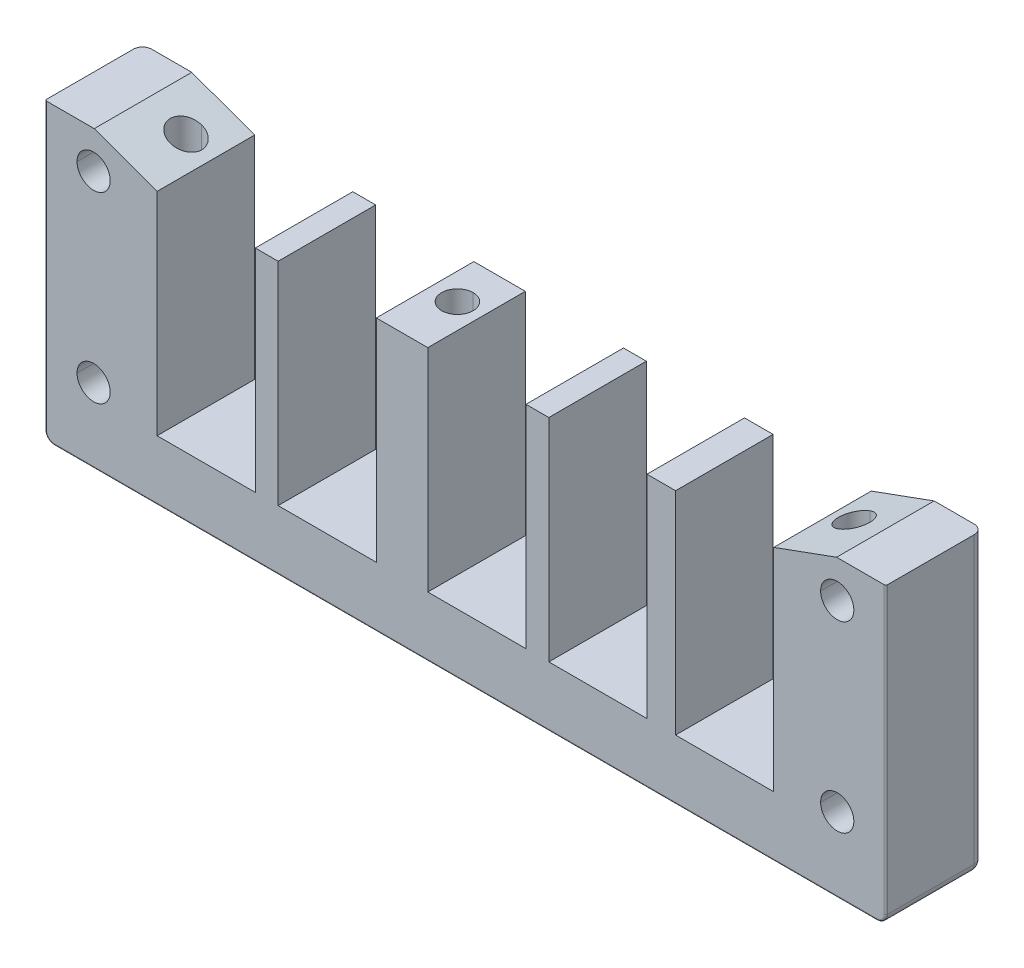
ISO-10303-21;
HEADER;
FILE_DESCRIPTION(('STEP AP214'),'2;1');
FILE_NAME('part.step','',(''),(''),'','','');
FILE_SCHEMA(('AUTOMOTIVE_DESIGN { 1 0 10303 214 1 1 1 1 }'));
ENDSEC;
DATA;
#1=APPLICATION_CONTEXT('core data for automotive mechanical design processes');
#2=APPLICATION_PROTOCOL_DEFINITION('international standard','automotive_design',2000,#1);
#3=PRODUCT_CONTEXT('',#1,'mechanical');
#4=PRODUCT('Part','Part','',(#3));
#5=PRODUCT_RELATED_PRODUCT_CATEGORY('part','',(#4));
#6=PRODUCT_DEFINITION_FORMATION('','',#4);
#7=PRODUCT_DEFINITION_CONTEXT('part definition',#1,'design');
#8=PRODUCT_DEFINITION('design','',#6,#7);
#9=PRODUCT_DEFINITION_SHAPE('','',#8);
#10=(LENGTH_UNIT() NAMED_UNIT(*) SI_UNIT(.MILLI.,.METRE.));
#11=(NAMED_UNIT(*) PLANE_ANGLE_UNIT() SI_UNIT($,.RADIAN.));
#12=(NAMED_UNIT(*) SI_UNIT($,.STERADIAN.) SOLID_ANGLE_UNIT());
#13=UNCERTAINTY_MEASURE_WITH_UNIT(LENGTH_MEASURE(1.E-05),#10,'distance_accuracy_value','');
#14=(GEOMETRIC_REPRESENTATION_CONTEXT(3) GLOBAL_UNCERTAINTY_ASSIGNED_CONTEXT((#13)) GLOBAL_UNIT_ASSIGNED_CONTEXT((#10,
#11,#12)) REPRESENTATION_CONTEXT('',''));
#15=CARTESIAN_POINT('',(0.,0.,0.));
#16=DIRECTION('',(0.,0.,1.));
#17=DIRECTION('',(1.,0.,0.));
#18=AXIS2_PLACEMENT_3D('',#15,#16,#17);
#19=CARTESIAN_POINT('',(60.7671361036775,-22.,3.4));
#20=DIRECTION('',(0.86602540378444,0.,-0.5));
#21=DIRECTION('',(0.,-1.,0.));
#22=AXIS2_PLACEMENT_3D('',#19,#20,#21);
#23=PLANE('',#22);
#24=DIRECTION('',(0.5,0.,0.86602540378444));
#25=VECTOR('',#24,1.);
#26=CARTESIAN_POINT('',(60.7671361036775,-29.,3.4));
#27=LINE('',#26,#25);
#28=CARTESIAN_POINT('',(60.7671361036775,-29.,3.4));
#29=VERTEX_POINT('',#28);
#30=CARTESIAN_POINT('',(63.1342722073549,-29.,7.5));
#31=VERTEX_POINT('',#30);
#32=EDGE_CURVE('E592',#29,#31,#27,.T.);
#33=ORIENTED_EDGE('',*,*,#32,.T.);
#34=DIRECTION('',(0.,-1.,0.));
#35=VECTOR('',#34,1.);
#36=CARTESIAN_POINT('',(63.1342722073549,-22.,7.5));
#37=LINE('',#36,#35);
#38=CARTESIAN_POINT('',(63.1342722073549,-22.,7.5));
#39=VERTEX_POINT('',#38);
#40=EDGE_CURVE('E11',#39,#31,#37,.T.);
#41=ORIENTED_EDGE('',*,*,#40,.F.);
#42=DIRECTION('',(0.5,0.,0.86602540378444));
#43=VECTOR('',#42,1.);
#44=CARTESIAN_POINT('',(60.7671361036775,-22.,3.4));
#45=LINE('',#44,#43);
#46=CARTESIAN_POINT('',(60.7671361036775,-22.,3.4));
#47=VERTEX_POINT('',#46);
#48=EDGE_CURVE('E470',#47,#39,#45,.T.);
#49=ORIENTED_EDGE('',*,*,#48,.F.);
#50=DIRECTION('',(0.,-1.,0.));
#51=VECTOR('',#50,1.);
#52=CARTESIAN_POINT('',(60.7671361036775,-22.,3.4));
#53=LINE('',#52,#51);
#54=EDGE_CURVE('E482',#47,#29,#53,.T.);
#55=ORIENTED_EDGE('',*,*,#54,.T.);
#56=EDGE_LOOP('',(#33,#41,#49,#55));
#57=FACE_BOUND('',#56,.T.);
#58=ADVANCED_FACE('F16',(#57),#23,.F.);
#59=CARTESIAN_POINT('',(63.1342722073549,-22.,7.5));
#60=DIRECTION('',(0.86602540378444,0.,0.5));
#61=DIRECTION('',(0.,-1.,0.));
#62=AXIS2_PLACEMENT_3D('',#59,#60,#61);
#63=PLANE('',#62);
#64=DIRECTION('',(-0.5,0.,0.86602540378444));
#65=VECTOR('',#64,1.);
#66=CARTESIAN_POINT('',(63.1342722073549,-29.,7.5));
#67=LINE('',#66,#65);
#68=CARTESIAN_POINT('',(60.7671361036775,-29.,11.6));
#69=VERTEX_POINT('',#68);
#70=EDGE_CURVE('E452',#31,#69,#67,.T.);
#71=ORIENTED_EDGE('',*,*,#70,.T.);
#72=DIRECTION('',(0.,-1.,0.));
#73=VECTOR('',#72,1.);
#74=CARTESIAN_POINT('',(60.7671361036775,-22.,11.6));
#75=LINE('',#74,#73);
#76=CARTESIAN_POINT('',(60.7671361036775,-22.,11.6));
#77=VERTEX_POINT('',#76);
#78=EDGE_CURVE('E25',#77,#69,#75,.T.);
#79=ORIENTED_EDGE('',*,*,#78,.F.);
#80=DIRECTION('',(-0.5,0.,0.86602540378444));
#81=VECTOR('',#80,1.);
#82=CARTESIAN_POINT('',(63.1342722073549,-22.,7.5));
#83=LINE('',#82,#81);
#84=EDGE_CURVE('E449',#39,#77,#83,.T.);
#85=ORIENTED_EDGE('',*,*,#84,.F.);
#86=ORIENTED_EDGE('',*,*,#40,.T.);
#87=EDGE_LOOP('',(#71,#79,#85,#86));
#88=FACE_BOUND('',#87,.T.);
#89=ADVANCED_FACE('F447',(#88),#63,.F.);
#90=CARTESIAN_POINT('',(60.7671361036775,-22.,11.6));
#91=DIRECTION('',(0.,0.,1.));
#92=DIRECTION('',(1.,0.,0.));
#93=AXIS2_PLACEMENT_3D('',#90,#91,#92);
#94=PLANE('',#93);
#95=DIRECTION('',(-1.,0.,0.));
#96=VECTOR('',#95,1.);
#97=CARTESIAN_POINT('',(60.7671361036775,-29.,11.6));
#98=LINE('',#97,#96);
#99=CARTESIAN_POINT('',(56.0328638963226,-29.,11.6));
#100=VERTEX_POINT('',#99);
#101=EDGE_CURVE('E597',#69,#100,#98,.T.);
#102=ORIENTED_EDGE('',*,*,#101,.T.);
#103=DIRECTION('',(0.,-1.,0.));
#104=VECTOR('',#103,1.);
#105=CARTESIAN_POINT('',(56.0328638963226,-22.,11.6));
#106=LINE('',#105,#104);
#107=CARTESIAN_POINT('',(56.0328638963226,-22.,11.6));
#108=VERTEX_POINT('',#107);
#109=EDGE_CURVE('E457',#108,#100,#106,.T.);
#110=ORIENTED_EDGE('',*,*,#109,.F.);
#111=DIRECTION('',(-1.,0.,0.));
#112=VECTOR('',#111,1.);
#113=CARTESIAN_POINT('',(60.7671361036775,-22.,11.6));
#114=LINE('',#113,#112);
#115=EDGE_CURVE('E459',#77,#108,#114,.T.);
#116=ORIENTED_EDGE('',*,*,#115,.F.);
#117=ORIENTED_EDGE('',*,*,#78,.T.);
#118=EDGE_LOOP('',(#102,#110,#116,#117));
#119=FACE_BOUND('',#118,.T.);
#120=ADVANCED_FACE('F460',(#119),#94,.F.);
#121=CARTESIAN_POINT('',(56.0328638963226,-22.,11.6));
#122=DIRECTION('',(-0.866025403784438,0.,0.5));
#123=DIRECTION('',(0.,1.,0.));
#124=AXIS2_PLACEMENT_3D('',#121,#122,#123);
#125=PLANE('',#124);
#126=DIRECTION('',(-0.5,0.,-0.866025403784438));
#127=VECTOR('',#126,1.);
#128=CARTESIAN_POINT('',(56.0328638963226,-29.,11.6));
#129=LINE('',#128,#127);
#130=CARTESIAN_POINT('',(53.6657277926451,-29.,7.5));
#131=VERTEX_POINT('',#130);
#132=EDGE_CURVE('E609',#100,#131,#129,.T.);
#133=ORIENTED_EDGE('',*,*,#132,.T.);
#134=DIRECTION('',(0.,-1.,0.));
#135=VECTOR('',#134,1.);
#136=CARTESIAN_POINT('',(53.6657277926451,-22.,7.5));
#137=LINE('',#136,#135);
#138=CARTESIAN_POINT('',(53.6657277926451,-22.,7.5));
#139=VERTEX_POINT('',#138);
#140=EDGE_CURVE('E37',#139,#131,#137,.T.);
#141=ORIENTED_EDGE('',*,*,#140,.F.);
#142=DIRECTION('',(-0.5,0.,-0.866025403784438));
#143=VECTOR('',#142,1.);
#144=CARTESIAN_POINT('',(56.0328638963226,-22.,11.6));
#145=LINE('',#144,#143);
#146=EDGE_CURVE('E465',#108,#139,#145,.T.);
#147=ORIENTED_EDGE('',*,*,#146,.F.);
#148=ORIENTED_EDGE('',*,*,#109,.T.);
#149=EDGE_LOOP('',(#133,#141,#147,#148));
#150=FACE_BOUND('',#149,.T.);
#151=ADVANCED_FACE('F1764',(#150),#125,.F.);
#152=CARTESIAN_POINT('',(53.6657277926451,-22.,7.5));
#153=DIRECTION('',(-0.866025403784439,0.,-0.5));
#154=DIRECTION('',(-0.5,0.,0.866025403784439));
#155=AXIS2_PLACEMENT_3D('',#152,#153,#154);
#156=PLANE('',#155);
#157=DIRECTION('',(0.5,0.,-0.866025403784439));
#158=VECTOR('',#157,1.);
#159=CARTESIAN_POINT('',(53.6657277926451,-29.,7.5));
#160=LINE('',#159,#158);
#161=CARTESIAN_POINT('',(56.0328638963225,-29.,3.4));
#162=VERTEX_POINT('',#161);
#163=EDGE_CURVE('E829',#131,#162,#160,.T.);
#164=ORIENTED_EDGE('',*,*,#163,.T.);
#165=DIRECTION('',(0.,-1.,0.));
#166=VECTOR('',#165,1.);
#167=CARTESIAN_POINT('',(56.0328638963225,-22.,3.4));
#168=LINE('',#167,#166);
#169=CARTESIAN_POINT('',(56.0328638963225,-22.,3.4));
#170=VERTEX_POINT('',#169);
#171=EDGE_CURVE('E486',#170,#162,#168,.T.);
#172=ORIENTED_EDGE('',*,*,#171,.F.);
#173=DIRECTION('',(0.5,0.,-0.866025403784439));
#174=VECTOR('',#173,1.);
#175=CARTESIAN_POINT('',(53.6657277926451,-22.,7.5));
#176=LINE('',#175,#174);
#177=EDGE_CURVE('E481',#139,#170,#176,.T.);
#178=ORIENTED_EDGE('',*,*,#177,.F.);
#179=ORIENTED_EDGE('',*,*,#140,.T.);
#180=EDGE_LOOP('',(#164,#172,#178,#179));
#181=FACE_BOUND('',#180,.T.);
#182=ADVANCED_FACE('F2599',(#181),#156,.F.);
#183=CARTESIAN_POINT('',(56.0328638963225,-22.,3.4));
#184=DIRECTION('',(0.,0.,-1.));
#185=DIRECTION('',(-1.,0.,0.));
#186=AXIS2_PLACEMENT_3D('',#183,#184,#185);
#187=PLANE('',#186);
#188=DIRECTION('',(1.,0.,0.));
#189=VECTOR('',#188,1.);
#190=CARTESIAN_POINT('',(56.0328638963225,-29.,3.4));
#191=LINE('',#190,#189);
#192=EDGE_CURVE('E588',#162,#29,#191,.T.);
#193=ORIENTED_EDGE('',*,*,#192,.T.);
#194=ORIENTED_EDGE('',*,*,#54,.F.);
#195=DIRECTION('',(1.,0.,0.));
#196=VECTOR('',#195,1.);
#197=CARTESIAN_POINT('',(56.0328638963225,-22.,3.4));
#198=LINE('',#197,#196);
#199=EDGE_CURVE('E475',#170,#47,#198,.T.);
#200=ORIENTED_EDGE('',*,*,#199,.F.);
#201=ORIENTED_EDGE('',*,*,#171,.T.);
#202=EDGE_LOOP('',(#193,#194,#200,#201));
#203=FACE_BOUND('',#202,.T.);
#204=ADVANCED_FACE('F586',(#203),#187,.F.);
#205=CARTESIAN_POINT('',(0.,-22.,0.));
#206=DIRECTION('',(0.,-1.,0.));
#207=DIRECTION('',(0.,0.,-1.));
#208=AXIS2_PLACEMENT_3D('',#205,#206,#207);
#209=PLANE('',#208);
#210=CARTESIAN_POINT('',(58.4,-22.,7.5));
#211=DIRECTION('',(0.,1.,0.));
#212=DIRECTION('',(0.,0.,-1.));
#213=AXIS2_PLACEMENT_3D('',#210,#211,#212);
#214=CIRCLE('',#213,2.75);
#215=CARTESIAN_POINT('',(58.4,-22.,10.25));
#216=VERTEX_POINT('',#215);
#217=CARTESIAN_POINT('',(58.4,-22.,4.75));
#218=VERTEX_POINT('',#217);
#219=EDGE_CURVE('E956',#216,#218,#214,.T.);
#220=ORIENTED_EDGE('',*,*,#219,.T.);
#221=CARTESIAN_POINT('',(58.4,-22.,7.5));
#222=DIRECTION('',(0.,1.,0.));
#223=DIRECTION('',(0.,0.,-1.));
#224=AXIS2_PLACEMENT_3D('',#221,#222,#223);
#225=CIRCLE('',#224,2.75);
#226=EDGE_CURVE('E922',#218,#216,#225,.T.);
#227=ORIENTED_EDGE('',*,*,#226,.T.);
#228=EDGE_LOOP('',(#220,#227));
#229=FACE_BOUND('',#228,.T.);
#230=ORIENTED_EDGE('',*,*,#199,.T.);
#231=ORIENTED_EDGE('',*,*,#48,.T.);
#232=ORIENTED_EDGE('',*,*,#84,.T.);
#233=ORIENTED_EDGE('',*,*,#115,.T.);
#234=ORIENTED_EDGE('',*,*,#146,.T.);
#235=ORIENTED_EDGE('',*,*,#177,.T.);
#236=EDGE_LOOP('',(#230,#231,#232,#233,#234,#235));
#237=FACE_BOUND('',#236,.T.);
#238=ADVANCED_FACE('F468',(#229,#237),#209,.T.);
#239=CARTESIAN_POINT('',(-8.58286389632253,-22.,3.4));
#240=DIRECTION('',(0.866025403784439,0.,-0.5));
#241=DIRECTION('',(0.,-1.,0.));
#242=AXIS2_PLACEMENT_3D('',#239,#240,#241);
#243=PLANE('',#242);
#244=DIRECTION('',(0.5,0.,0.866025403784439));
#245=VECTOR('',#244,1.);
#246=CARTESIAN_POINT('',(-8.58286389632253,-29.,3.4));
#247=LINE('',#246,#245);
#248=CARTESIAN_POINT('',(-8.58286389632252,-29.,3.4));
#249=VERTEX_POINT('',#248);
#250=CARTESIAN_POINT('',(-6.21572779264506,-29.,7.5));
#251=VERTEX_POINT('',#250);
#252=EDGE_CURVE('E599',#249,#251,#247,.T.);
#253=ORIENTED_EDGE('',*,*,#252,.T.);
#254=DIRECTION('',(0.,-1.,0.));
#255=VECTOR('',#254,1.);
#256=CARTESIAN_POINT('',(-6.21572779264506,-22.,7.5));
#257=LINE('',#256,#255);
#258=CARTESIAN_POINT('',(-6.21572779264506,-22.,7.5));
#259=VERTEX_POINT('',#258);
#260=EDGE_CURVE('E578',#259,#251,#257,.T.);
#261=ORIENTED_EDGE('',*,*,#260,.F.);
#262=DIRECTION('',(0.5,0.,0.866025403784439));
#263=VECTOR('',#262,1.);
#264=CARTESIAN_POINT('',(-8.58286389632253,-22.,3.4));
#265=LINE('',#264,#263);
#266=CARTESIAN_POINT('',(-8.58286389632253,-22.,3.4));
#267=VERTEX_POINT('',#266);
#268=EDGE_CURVE('E543',#267,#259,#265,.T.);
#269=ORIENTED_EDGE('',*,*,#268,.F.);
#270=DIRECTION('',(0.,-1.,0.));
#271=VECTOR('',#270,1.);
#272=CARTESIAN_POINT('',(-8.58286389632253,-22.,3.4));
#273=LINE('',#272,#271);
#274=EDGE_CURVE('E563',#267,#249,#273,.T.);
#275=ORIENTED_EDGE('',*,*,#274,.T.);
#276=EDGE_LOOP('',(#253,#261,#269,#275));
#277=FACE_BOUND('',#276,.T.);
#278=ADVANCED_FACE('F1790',(#277),#243,.F.);
#279=CARTESIAN_POINT('',(-6.21572779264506,-22.,7.5));
#280=DIRECTION('',(0.866025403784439,0.,0.5));
#281=DIRECTION('',(0.,-1.,0.));
#282=AXIS2_PLACEMENT_3D('',#279,#280,#281);
#283=PLANE('',#282);
#284=DIRECTION('',(-0.5,0.,0.866025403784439));
#285=VECTOR('',#284,1.);
#286=CARTESIAN_POINT('',(-6.21572779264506,-29.,7.5));
#287=LINE('',#286,#285);
#288=CARTESIAN_POINT('',(-8.58286389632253,-29.,11.6));
#289=VERTEX_POINT('',#288);
#290=EDGE_CURVE('E1034',#251,#289,#287,.T.);
#291=ORIENTED_EDGE('',*,*,#290,.T.);
#292=DIRECTION('',(0.,-1.,0.));
#293=VECTOR('',#292,1.);
#294=CARTESIAN_POINT('',(-8.58286389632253,-22.,11.6));
#295=LINE('',#294,#293);
#296=CARTESIAN_POINT('',(-8.58286389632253,-22.,11.6));
#297=VERTEX_POINT('',#296);
#298=EDGE_CURVE('E575',#297,#289,#295,.T.);
#299=ORIENTED_EDGE('',*,*,#298,.F.);
#300=DIRECTION('',(-0.5,0.,0.866025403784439));
#301=VECTOR('',#300,1.);
#302=CARTESIAN_POINT('',(-6.21572779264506,-22.,7.5));
#303=LINE('',#302,#301);
#304=EDGE_CURVE('E547',#259,#297,#303,.T.);
#305=ORIENTED_EDGE('',*,*,#304,.F.);
#306=ORIENTED_EDGE('',*,*,#260,.T.);
#307=EDGE_LOOP('',(#291,#299,#305,#306));
#308=FACE_BOUND('',#307,.T.);
#309=ADVANCED_FACE('F1787',(#308),#283,.F.);
#310=CARTESIAN_POINT('',(-8.58286389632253,-22.,11.6));
#311=DIRECTION('',(0.,0.,1.));
#312=DIRECTION('',(1.,0.,0.));
#313=AXIS2_PLACEMENT_3D('',#310,#311,#312);
#314=PLANE('',#313);
#315=DIRECTION('',(-1.,0.,0.));
#316=VECTOR('',#315,1.);
#317=CARTESIAN_POINT('',(-8.58286389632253,-29.,11.6));
#318=LINE('',#317,#316);
#319=CARTESIAN_POINT('',(-13.3171361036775,-29.,11.6));
#320=VERTEX_POINT('',#319);
#321=EDGE_CURVE('E1030',#289,#320,#318,.T.);
#322=ORIENTED_EDGE('',*,*,#321,.T.);
#323=DIRECTION('',(0.,-1.,0.));
#324=VECTOR('',#323,1.);
#325=CARTESIAN_POINT('',(-13.3171361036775,-22.,11.6));
#326=LINE('',#325,#324);
#327=CARTESIAN_POINT('',(-13.3171361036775,-22.,11.6));
#328=VERTEX_POINT('',#327);
#329=EDGE_CURVE('E572',#328,#320,#326,.T.);
#330=ORIENTED_EDGE('',*,*,#329,.F.);
#331=DIRECTION('',(-1.,0.,0.));
#332=VECTOR('',#331,1.);
#333=CARTESIAN_POINT('',(-8.58286389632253,-22.,11.6));
#334=LINE('',#333,#332);
#335=EDGE_CURVE('E551',#297,#328,#334,.T.);
#336=ORIENTED_EDGE('',*,*,#335,.F.);
#337=ORIENTED_EDGE('',*,*,#298,.T.);
#338=EDGE_LOOP('',(#322,#330,#336,#337));
#339=FACE_BOUND('',#338,.T.);
#340=ADVANCED_FACE('F1789',(#339),#314,.F.);
#341=CARTESIAN_POINT('',(-13.3171361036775,-22.,11.6));
#342=DIRECTION('',(-0.866025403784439,0.,0.5));
#343=DIRECTION('',(0.,1.,0.));
#344=AXIS2_PLACEMENT_3D('',#341,#342,#343);
#345=PLANE('',#344);
#346=DIRECTION('',(-0.5,0.,-0.866025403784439));
#347=VECTOR('',#346,1.);
#348=CARTESIAN_POINT('',(-13.3171361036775,-29.,11.6));
#349=LINE('',#348,#347);
#350=CARTESIAN_POINT('',(-15.6842722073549,-29.,7.5));
#351=VERTEX_POINT('',#350);
#352=EDGE_CURVE('E1026',#320,#351,#349,.T.);
#353=ORIENTED_EDGE('',*,*,#352,.T.);
#354=DIRECTION('',(0.,-1.,0.));
#355=VECTOR('',#354,1.);
#356=CARTESIAN_POINT('',(-15.6842722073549,-22.,7.5));
#357=LINE('',#356,#355);
#358=CARTESIAN_POINT('',(-15.6842722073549,-22.,7.5));
#359=VERTEX_POINT('',#358);
#360=EDGE_CURVE('E569',#359,#351,#357,.T.);
#361=ORIENTED_EDGE('',*,*,#360,.F.);
#362=DIRECTION('',(-0.5,0.,-0.866025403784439));
#363=VECTOR('',#362,1.);
#364=CARTESIAN_POINT('',(-13.3171361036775,-22.,11.6));
#365=LINE('',#364,#363);
#366=EDGE_CURVE('E555',#328,#359,#365,.T.);
#367=ORIENTED_EDGE('',*,*,#366,.F.);
#368=ORIENTED_EDGE('',*,*,#329,.T.);
#369=EDGE_LOOP('',(#353,#361,#367,#368));
#370=FACE_BOUND('',#369,.T.);
#371=ADVANCED_FACE('F2544',(#370),#345,.F.);
#372=CARTESIAN_POINT('',(-15.6842722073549,-22.,7.5));
#373=DIRECTION('',(-0.866025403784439,0.,-0.5));
#374=DIRECTION('',(-0.5,0.,0.866025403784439));
#375=AXIS2_PLACEMENT_3D('',#372,#373,#374);
#376=PLANE('',#375);
#377=DIRECTION('',(0.5,0.,-0.866025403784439));
#378=VECTOR('',#377,1.);
#379=CARTESIAN_POINT('',(-15.6842722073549,-29.,7.5));
#380=LINE('',#379,#378);
#381=CARTESIAN_POINT('',(-13.3171361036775,-29.,3.4));
#382=VERTEX_POINT('',#381);
#383=EDGE_CURVE('E1022',#351,#382,#380,.T.);
#384=ORIENTED_EDGE('',*,*,#383,.T.);
#385=DIRECTION('',(0.,-1.,0.));
#386=VECTOR('',#385,1.);
#387=CARTESIAN_POINT('',(-13.3171361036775,-22.,3.4));
#388=LINE('',#387,#386);
#389=CARTESIAN_POINT('',(-13.3171361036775,-22.,3.4));
#390=VERTEX_POINT('',#389);
#391=EDGE_CURVE('E566',#390,#382,#388,.T.);
#392=ORIENTED_EDGE('',*,*,#391,.F.);
#393=DIRECTION('',(0.5,0.,-0.866025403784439));
#394=VECTOR('',#393,1.);
#395=CARTESIAN_POINT('',(-15.6842722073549,-22.,7.5));
#396=LINE('',#395,#394);
#397=EDGE_CURVE('E559',#359,#390,#396,.T.);
#398=ORIENTED_EDGE('',*,*,#397,.F.);
#399=ORIENTED_EDGE('',*,*,#360,.T.);
#400=EDGE_LOOP('',(#384,#392,#398,#399));
#401=FACE_BOUND('',#400,.T.);
#402=ADVANCED_FACE('F2533',(#401),#376,.F.);
#403=CARTESIAN_POINT('',(-13.3171361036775,-22.,3.4));
#404=DIRECTION('',(0.,0.,-1.));
#405=DIRECTION('',(0.,-1.,0.));
#406=AXIS2_PLACEMENT_3D('',#403,#404,#405);
#407=PLANE('',#406);
#408=DIRECTION('',(1.,0.,0.));
#409=VECTOR('',#408,1.);
#410=CARTESIAN_POINT('',(-13.3171361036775,-29.,3.4));
#411=LINE('',#410,#409);
#412=EDGE_CURVE('E606',#382,#249,#411,.T.);
#413=ORIENTED_EDGE('',*,*,#412,.T.);
#414=ORIENTED_EDGE('',*,*,#274,.F.);
#415=DIRECTION('',(1.,0.,0.));
#416=VECTOR('',#415,1.);
#417=CARTESIAN_POINT('',(-13.3171361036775,-22.,3.4));
#418=LINE('',#417,#416);
#419=EDGE_CURVE('E539',#390,#267,#418,.T.);
#420=ORIENTED_EDGE('',*,*,#419,.F.);
#421=ORIENTED_EDGE('',*,*,#391,.T.);
#422=EDGE_LOOP('',(#413,#414,#420,#421));
#423=FACE_BOUND('',#422,.T.);
#424=ADVANCED_FACE('F2522',(#423),#407,.F.);
#425=CARTESIAN_POINT('',(0.,-22.,0.));
#426=DIRECTION('',(0.,-1.,0.));
#427=DIRECTION('',(0.,0.,-1.));
#428=AXIS2_PLACEMENT_3D('',#425,#426,#427);
#429=PLANE('',#428);
#430=CARTESIAN_POINT('',(-10.95,-22.,7.5));
#431=DIRECTION('',(0.,1.,0.));
#432=DIRECTION('',(1.,0.,0.));
#433=AXIS2_PLACEMENT_3D('',#430,#431,#432);
#434=CIRCLE('',#433,2.75);
#435=CARTESIAN_POINT('',(-10.95,-22.,10.25));
#436=VERTEX_POINT('',#435);
#437=CARTESIAN_POINT('',(-10.95,-22.,4.75));
#438=VERTEX_POINT('',#437);
#439=EDGE_CURVE('E739',#436,#438,#434,.T.);
#440=ORIENTED_EDGE('',*,*,#439,.T.);
#441=CARTESIAN_POINT('',(-10.95,-22.,7.5));
#442=DIRECTION('',(0.,1.,0.));
#443=DIRECTION('',(1.,0.,0.));
#444=AXIS2_PLACEMENT_3D('',#441,#442,#443);
#445=CIRCLE('',#444,2.75);
#446=EDGE_CURVE('E894',#438,#436,#445,.T.);
#447=ORIENTED_EDGE('',*,*,#446,.T.);
#448=EDGE_LOOP('',(#440,#447));
#449=FACE_BOUND('',#448,.T.);
#450=ORIENTED_EDGE('',*,*,#419,.T.);
#451=ORIENTED_EDGE('',*,*,#268,.T.);
#452=ORIENTED_EDGE('',*,*,#304,.T.);
#453=ORIENTED_EDGE('',*,*,#335,.T.);
#454=ORIENTED_EDGE('',*,*,#366,.T.);
#455=ORIENTED_EDGE('',*,*,#397,.T.);
#456=EDGE_LOOP('',(#450,#451,#452,#453,#454,#455));
#457=FACE_BOUND('',#456,.T.);
#458=ADVANCED_FACE('F2513',(#449,#457),#429,.T.);
#459=CARTESIAN_POINT('',(-56.0328638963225,-22.,3.4));
#460=DIRECTION('',(0.866025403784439,0.,-0.5));
#461=DIRECTION('',(0.,-1.,0.));
#462=AXIS2_PLACEMENT_3D('',#459,#460,#461);
#463=PLANE('',#462);
#464=DIRECTION('',(0.5,0.,0.866025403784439));
#465=VECTOR('',#464,1.);
#466=CARTESIAN_POINT('',(-56.0328638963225,-29.,3.4));
#467=LINE('',#466,#465);
#468=CARTESIAN_POINT('',(-56.0328638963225,-29.,3.4));
#469=VERTEX_POINT('',#468);
#470=CARTESIAN_POINT('',(-53.6657277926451,-29.,7.5));
#471=VERTEX_POINT('',#470);
#472=EDGE_CURVE('E675',#469,#471,#467,.T.);
#473=ORIENTED_EDGE('',*,*,#472,.T.);
#474=DIRECTION('',(0.,-1.,0.));
#475=VECTOR('',#474,1.);
#476=CARTESIAN_POINT('',(-53.6657277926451,-22.,7.5));
#477=LINE('',#476,#475);
#478=CARTESIAN_POINT('',(-53.6657277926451,-22.,7.5));
#479=VERTEX_POINT('',#478);
#480=EDGE_CURVE('E536',#479,#471,#477,.T.);
#481=ORIENTED_EDGE('',*,*,#480,.F.);
#482=DIRECTION('',(0.5,0.,0.866025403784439));
#483=VECTOR('',#482,1.);
#484=CARTESIAN_POINT('',(-56.0328638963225,-22.,3.4));
#485=LINE('',#484,#483);
#486=CARTESIAN_POINT('',(-56.0328638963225,-22.,3.4));
#487=VERTEX_POINT('',#486);
#488=EDGE_CURVE('E502',#487,#479,#485,.T.);
#489=ORIENTED_EDGE('',*,*,#488,.F.);
#490=DIRECTION('',(0.,-1.,0.));
#491=VECTOR('',#490,1.);
#492=CARTESIAN_POINT('',(-56.0328638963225,-22.,3.4));
#493=LINE('',#492,#491);
#494=EDGE_CURVE('E519',#487,#469,#493,.T.);
#495=ORIENTED_EDGE('',*,*,#494,.T.);
#496=EDGE_LOOP('',(#473,#481,#489,#495));
#497=FACE_BOUND('',#496,.T.);
#498=ADVANCED_FACE('F1366',(#497),#463,.F.);
#499=CARTESIAN_POINT('',(-53.6657277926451,-22.,7.5));
#500=DIRECTION('',(0.866025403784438,0.,0.5));
#501=DIRECTION('',(0.,-1.,0.));
#502=AXIS2_PLACEMENT_3D('',#499,#500,#501);
#503=PLANE('',#502);
#504=DIRECTION('',(-0.5,0.,0.866025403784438));
#505=VECTOR('',#504,1.);
#506=CARTESIAN_POINT('',(-53.6657277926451,-29.,7.5));
#507=LINE('',#506,#505);
#508=CARTESIAN_POINT('',(-56.0328638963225,-29.,11.6));
#509=VERTEX_POINT('',#508);
#510=EDGE_CURVE('E910',#471,#509,#507,.T.);
#511=ORIENTED_EDGE('',*,*,#510,.T.);
#512=DIRECTION('',(0.,-1.,0.));
#513=VECTOR('',#512,1.);
#514=CARTESIAN_POINT('',(-56.0328638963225,-22.,11.6));
#515=LINE('',#514,#513);
#516=CARTESIAN_POINT('',(-56.0328638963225,-22.,11.6));
#517=VERTEX_POINT('',#516);
#518=EDGE_CURVE('E533',#517,#509,#515,.T.);
#519=ORIENTED_EDGE('',*,*,#518,.F.);
#520=DIRECTION('',(-0.5,0.,0.866025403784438));
#521=VECTOR('',#520,1.);
#522=CARTESIAN_POINT('',(-53.6657277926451,-22.,7.5));
#523=LINE('',#522,#521);
#524=EDGE_CURVE('E504',#479,#517,#523,.T.);
#525=ORIENTED_EDGE('',*,*,#524,.F.);
#526=ORIENTED_EDGE('',*,*,#480,.T.);
#527=EDGE_LOOP('',(#511,#519,#525,#526));
#528=FACE_BOUND('',#527,.T.);
#529=ADVANCED_FACE('F1370',(#528),#503,.F.);
#530=CARTESIAN_POINT('',(-56.0328638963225,-22.,11.6));
#531=DIRECTION('',(0.,0.,1.));
#532=DIRECTION('',(1.,0.,0.));
#533=AXIS2_PLACEMENT_3D('',#530,#531,#532);
#534=PLANE('',#533);
#535=DIRECTION('',(-1.,0.,0.));
#536=VECTOR('',#535,1.);
#537=CARTESIAN_POINT('',(-56.0328638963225,-29.,11.6));
#538=LINE('',#537,#536);
#539=CARTESIAN_POINT('',(-60.7671361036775,-29.,11.6));
#540=VERTEX_POINT('',#539);
#541=EDGE_CURVE('E798',#509,#540,#538,.T.);
#542=ORIENTED_EDGE('',*,*,#541,.T.);
#543=DIRECTION('',(0.,-1.,0.));
#544=VECTOR('',#543,1.);
#545=CARTESIAN_POINT('',(-60.7671361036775,-22.,11.6));
#546=LINE('',#545,#544);
#547=CARTESIAN_POINT('',(-60.7671361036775,-22.,11.6));
#548=VERTEX_POINT('',#547);
#549=EDGE_CURVE('E529',#548,#540,#546,.T.);
#550=ORIENTED_EDGE('',*,*,#549,.F.);
#551=DIRECTION('',(-1.,0.,0.));
#552=VECTOR('',#551,1.);
#553=CARTESIAN_POINT('',(-56.0328638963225,-22.,11.6));
#554=LINE('',#553,#552);
#555=EDGE_CURVE('E507',#517,#548,#554,.T.);
#556=ORIENTED_EDGE('',*,*,#555,.F.);
#557=ORIENTED_EDGE('',*,*,#518,.T.);
#558=EDGE_LOOP('',(#542,#550,#556,#557));
#559=FACE_BOUND('',#558,.T.);
#560=ADVANCED_FACE('F1374',(#559),#534,.F.);
#561=CARTESIAN_POINT('',(-60.7671361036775,-22.,11.6));
#562=DIRECTION('',(-0.866025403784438,0.,0.5));
#563=DIRECTION('',(0.,1.,0.));
#564=AXIS2_PLACEMENT_3D('',#561,#562,#563);
#565=PLANE('',#564);
#566=DIRECTION('',(-0.5,0.,-0.866025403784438));
#567=VECTOR('',#566,1.);
#568=CARTESIAN_POINT('',(-60.7671361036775,-29.,11.6));
#569=LINE('',#568,#567);
#570=CARTESIAN_POINT('',(-63.1342722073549,-29.,7.5));
#571=VERTEX_POINT('',#570);
#572=EDGE_CURVE('E780',#540,#571,#569,.T.);
#573=ORIENTED_EDGE('',*,*,#572,.T.);
#574=DIRECTION('',(0.,-1.,0.));
#575=VECTOR('',#574,1.);
#576=CARTESIAN_POINT('',(-63.1342722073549,-22.,7.5));
#577=LINE('',#576,#575);
#578=CARTESIAN_POINT('',(-63.1342722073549,-22.,7.5));
#579=VERTEX_POINT('',#578);
#580=EDGE_CURVE('E526',#579,#571,#577,.T.);
#581=ORIENTED_EDGE('',*,*,#580,.F.);
#582=DIRECTION('',(-0.5,0.,-0.866025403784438));
#583=VECTOR('',#582,1.);
#584=CARTESIAN_POINT('',(-60.7671361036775,-22.,11.6));
#585=LINE('',#584,#583);
#586=EDGE_CURVE('E511',#548,#579,#585,.T.);
#587=ORIENTED_EDGE('',*,*,#586,.F.);
#588=ORIENTED_EDGE('',*,*,#549,.T.);
#589=EDGE_LOOP('',(#573,#581,#587,#588));
#590=FACE_BOUND('',#589,.T.);
#591=ADVANCED_FACE('F1378',(#590),#565,.F.);
#592=CARTESIAN_POINT('',(-63.1342722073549,-22.,7.5));
#593=DIRECTION('',(-0.866025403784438,0.,-0.5));
#594=DIRECTION('',(-0.5,0.,0.866025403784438));
#595=AXIS2_PLACEMENT_3D('',#592,#593,#594);
#596=PLANE('',#595);
#597=DIRECTION('',(0.5,0.,-0.866025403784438));
#598=VECTOR('',#597,1.);
#599=CARTESIAN_POINT('',(-63.1342722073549,-29.,7.5));
#600=LINE('',#599,#598);
#601=CARTESIAN_POINT('',(-60.7671361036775,-29.,3.4));
#602=VERTEX_POINT('',#601);
#603=EDGE_CURVE('E674',#571,#602,#600,.T.);
#604=ORIENTED_EDGE('',*,*,#603,.T.);
#605=DIRECTION('',(0.,-1.,0.));
#606=VECTOR('',#605,1.);
#607=CARTESIAN_POINT('',(-60.7671361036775,-22.,3.4));
#608=LINE('',#607,#606);
#609=CARTESIAN_POINT('',(-60.7671361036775,-22.,3.4));
#610=VERTEX_POINT('',#609);
#611=EDGE_CURVE('E522',#610,#602,#608,.T.);
#612=ORIENTED_EDGE('',*,*,#611,.F.);
#613=DIRECTION('',(0.5,0.,-0.866025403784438));
#614=VECTOR('',#613,1.);
#615=CARTESIAN_POINT('',(-63.1342722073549,-22.,7.5));
#616=LINE('',#615,#614);
#617=EDGE_CURVE('E515',#579,#610,#616,.T.);
#618=ORIENTED_EDGE('',*,*,#617,.F.);
#619=ORIENTED_EDGE('',*,*,#580,.T.);
#620=EDGE_LOOP('',(#604,#612,#618,#619));
#621=FACE_BOUND('',#620,.T.);
#622=ADVANCED_FACE('F1382',(#621),#596,.F.);
#623=CARTESIAN_POINT('',(-60.7671361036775,-22.,3.4));
#624=DIRECTION('',(0.,0.,-1.));
#625=DIRECTION('',(0.,-1.,0.));
#626=AXIS2_PLACEMENT_3D('',#623,#624,#625);
#627=PLANE('',#626);
#628=DIRECTION('',(1.,0.,0.));
#629=VECTOR('',#628,1.);
#630=CARTESIAN_POINT('',(-60.7671361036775,-29.,3.4));
#631=LINE('',#630,#629);
#632=EDGE_CURVE('E670',#602,#469,#631,.T.);
#633=ORIENTED_EDGE('',*,*,#632,.T.);
#634=ORIENTED_EDGE('',*,*,#494,.F.);
#635=DIRECTION('',(1.,0.,0.));
#636=VECTOR('',#635,1.);
#637=CARTESIAN_POINT('',(-60.7671361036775,-22.,3.4));
#638=LINE('',#637,#636);
#639=EDGE_CURVE('E1354',#610,#487,#638,.T.);
#640=ORIENTED_EDGE('',*,*,#639,.F.);
#641=ORIENTED_EDGE('',*,*,#611,.T.);
#642=EDGE_LOOP('',(#633,#634,#640,#641));
#643=FACE_BOUND('',#642,.T.);
#644=ADVANCED_FACE('F1385',(#643),#627,.F.);
#645=CARTESIAN_POINT('',(0.,-22.,0.));
#646=DIRECTION('',(0.,-1.,0.));
#647=DIRECTION('',(0.,0.,-1.));
#648=AXIS2_PLACEMENT_3D('',#645,#646,#647);
#649=PLANE('',#648);
#650=CARTESIAN_POINT('',(-58.4,-22.,7.5));
#651=DIRECTION('',(0.,1.,0.));
#652=DIRECTION('',(0.,0.,-1.));
#653=AXIS2_PLACEMENT_3D('',#650,#651,#652);
#654=CIRCLE('',#653,2.75);
#655=CARTESIAN_POINT('',(-58.4,-22.,10.25));
#656=VERTEX_POINT('',#655);
#657=CARTESIAN_POINT('',(-58.4,-22.,4.75));
#658=VERTEX_POINT('',#657);
#659=EDGE_CURVE('E738',#656,#658,#654,.T.);
#660=ORIENTED_EDGE('',*,*,#659,.T.);
#661=CARTESIAN_POINT('',(-58.4,-22.,7.5));
#662=DIRECTION('',(0.,1.,0.));
#663=DIRECTION('',(0.,0.,-1.));
#664=AXIS2_PLACEMENT_3D('',#661,#662,#663);
#665=CIRCLE('',#664,2.75);
#666=EDGE_CURVE('E866',#658,#656,#665,.T.);
#667=ORIENTED_EDGE('',*,*,#666,.T.);
#668=EDGE_LOOP('',(#660,#667));
#669=FACE_BOUND('',#668,.T.);
#670=ORIENTED_EDGE('',*,*,#639,.T.);
#671=ORIENTED_EDGE('',*,*,#488,.T.);
#672=ORIENTED_EDGE('',*,*,#524,.T.);
#673=ORIENTED_EDGE('',*,*,#555,.T.);
#674=ORIENTED_EDGE('',*,*,#586,.T.);
#675=ORIENTED_EDGE('',*,*,#617,.T.);
#676=EDGE_LOOP('',(#670,#671,#672,#673,#674,#675));
#677=FACE_BOUND('',#676,.T.);
#678=ADVANCED_FACE('F1363',(#669,#677),#649,.T.);
#679=CARTESIAN_POINT('',(65.,16.,0.));
#680=DIRECTION('',(0.,0.,-1.));
#681=DIRECTION('',(-1.,0.,0.));
#682=AXIS2_PLACEMENT_3D('',#679,#680,#681);
#683=CYLINDRICAL_SURFACE('',#682,5.);
#684=DIRECTION('',(0.,0.,-1.));
#685=VECTOR('',#684,1.);
#686=CARTESIAN_POINT('',(70.,16.,0.));
#687=LINE('',#686,#685);
#688=CARTESIAN_POINT('',(70.,16.,4.9));
#689=VERTEX_POINT('',#688);
#690=CARTESIAN_POINT('',(70.,16.,0.));
#691=VERTEX_POINT('',#690);
#692=EDGE_CURVE('E614',#689,#691,#687,.T.);
#693=ORIENTED_EDGE('',*,*,#692,.F.);
#694=CARTESIAN_POINT('',(65.,16.,4.9));
#695=DIRECTION('',(0.,0.,-1.));
#696=DIRECTION('',(-1.,0.,0.));
#697=AXIS2_PLACEMENT_3D('',#694,#695,#696);
#698=CIRCLE('',#697,5.);
#699=CARTESIAN_POINT('',(60.,16.,4.9));
#700=VERTEX_POINT('',#699);
#701=EDGE_CURVE('E1351',#700,#689,#698,.T.);
#702=ORIENTED_EDGE('',*,*,#701,.F.);
#703=DIRECTION('',(0.,0.,-1.));
#704=VECTOR('',#703,1.);
#705=CARTESIAN_POINT('',(60.,16.,0.));
#706=LINE('',#705,#704);
#707=CARTESIAN_POINT('',(60.,16.,0.));
#708=VERTEX_POINT('',#707);
#709=EDGE_CURVE('E633',#700,#708,#706,.T.);
#710=ORIENTED_EDGE('',*,*,#709,.T.);
#711=CARTESIAN_POINT('',(65.,16.,0.));
#712=DIRECTION('',(0.,0.,-1.));
#713=DIRECTION('',(-1.,0.,0.));
#714=AXIS2_PLACEMENT_3D('',#711,#712,#713);
#715=CIRCLE('',#714,5.);
#716=EDGE_CURVE('E1238',#708,#691,#715,.T.);
#717=ORIENTED_EDGE('',*,*,#716,.T.);
#718=EDGE_LOOP('',(#693,#702,#710,#717));
#719=FACE_BOUND('',#718,.T.);
#720=ADVANCED_FACE('F2438',(#719),#683,.F.);
#721=CARTESIAN_POINT('',(67.9,16.,4.9));
#722=DIRECTION('',(0.,0.,1.));
#723=DIRECTION('',(1.,0.,0.));
#724=AXIS2_PLACEMENT_3D('',#721,#722,#723);
#725=PLANE('',#724);
#726=CARTESIAN_POINT('',(65.,16.,4.9));
#727=DIRECTION('',(0.,0.,-1.));
#728=DIRECTION('',(-1.,0.,0.));
#729=AXIS2_PLACEMENT_3D('',#726,#727,#728);
#730=CIRCLE('',#729,2.9);
#731=CARTESIAN_POINT('',(62.1,16.,4.9));
#732=VERTEX_POINT('',#731);
#733=CARTESIAN_POINT('',(67.9,16.,4.9));
#734=VERTEX_POINT('',#733);
#735=EDGE_CURVE('E1347',#732,#734,#730,.T.);
#736=ORIENTED_EDGE('',*,*,#735,.F.);
#737=CARTESIAN_POINT('',(65.,16.,4.9));
#738=DIRECTION('',(0.,0.,-1.));
#739=DIRECTION('',(-1.,0.,0.));
#740=AXIS2_PLACEMENT_3D('',#737,#738,#739);
#741=CIRCLE('',#740,2.9);
#742=EDGE_CURVE('E649',#734,#732,#741,.T.);
#743=ORIENTED_EDGE('',*,*,#742,.F.);
#744=EDGE_LOOP('',(#736,#743));
#745=FACE_BOUND('',#744,.T.);
#746=ORIENTED_EDGE('',*,*,#701,.T.);
#747=CARTESIAN_POINT('',(65.,16.,4.9));
#748=DIRECTION('',(0.,0.,-1.));
#749=DIRECTION('',(-1.,0.,0.));
#750=AXIS2_PLACEMENT_3D('',#747,#748,#749);
#751=CIRCLE('',#750,5.);
#752=EDGE_CURVE('E613',#689,#700,#751,.T.);
#753=ORIENTED_EDGE('',*,*,#752,.T.);
#754=EDGE_LOOP('',(#746,#753));
#755=FACE_BOUND('',#754,.T.);
#756=ADVANCED_FACE('F2427',(#745,#755),#725,.F.);
#757=CARTESIAN_POINT('',(65.,16.,0.));
#758=DIRECTION('',(0.,0.,-1.));
#759=DIRECTION('',(-1.,0.,0.));
#760=AXIS2_PLACEMENT_3D('',#757,#758,#759);
#761=CYLINDRICAL_SURFACE('',#760,2.9);
#762=DIRECTION('',(0.,0.,-1.));
#763=VECTOR('',#762,1.);
#764=CARTESIAN_POINT('',(67.9,16.,0.));
#765=LINE('',#764,#763);
#766=CARTESIAN_POINT('',(67.9,16.,17.05));
#767=VERTEX_POINT('',#766);
#768=EDGE_CURVE('E645',#767,#734,#765,.T.);
#769=ORIENTED_EDGE('',*,*,#768,.F.);
#770=CARTESIAN_POINT('',(65.,16.,17.05));
#771=DIRECTION('',(0.,0.,-1.));
#772=DIRECTION('',(-1.,0.,0.));
#773=AXIS2_PLACEMENT_3D('',#770,#771,#772);
#774=CIRCLE('',#773,2.9);
#775=CARTESIAN_POINT('',(62.1,16.,17.05));
#776=VERTEX_POINT('',#775);
#777=EDGE_CURVE('E1290',#776,#767,#774,.T.);
#778=ORIENTED_EDGE('',*,*,#777,.F.);
#779=DIRECTION('',(0.,0.,-1.));
#780=VECTOR('',#779,1.);
#781=CARTESIAN_POINT('',(62.1,16.,0.));
#782=LINE('',#781,#780);
#783=EDGE_CURVE('E665',#776,#732,#782,.T.);
#784=ORIENTED_EDGE('',*,*,#783,.T.);
#785=ORIENTED_EDGE('',*,*,#735,.T.);
#786=EDGE_LOOP('',(#769,#778,#784,#785));
#787=FACE_BOUND('',#786,.T.);
#788=ADVANCED_FACE('F2417',(#787),#761,.F.);
#789=CARTESIAN_POINT('',(65.,-16.,0.));
#790=DIRECTION('',(0.,0.,-1.));
#791=DIRECTION('',(-1.,0.,0.));
#792=AXIS2_PLACEMENT_3D('',#789,#790,#791);
#793=CYLINDRICAL_SURFACE('',#792,5.);
#794=DIRECTION('',(0.,0.,-1.));
#795=VECTOR('',#794,1.);
#796=CARTESIAN_POINT('',(70.,-16.,0.));
#797=LINE('',#796,#795);
#798=CARTESIAN_POINT('',(70.,-16.,4.9));
#799=VERTEX_POINT('',#798);
#800=CARTESIAN_POINT('',(70.,-16.,0.));
#801=VERTEX_POINT('',#800);
#802=EDGE_CURVE('E618',#799,#801,#797,.T.);
#803=ORIENTED_EDGE('',*,*,#802,.F.);
#804=CARTESIAN_POINT('',(65.,-16.,4.9));
#805=DIRECTION('',(0.,0.,-1.));
#806=DIRECTION('',(-1.,0.,0.));
#807=AXIS2_PLACEMENT_3D('',#804,#805,#806);
#808=CIRCLE('',#807,5.);
#809=CARTESIAN_POINT('',(60.,-16.,4.9));
#810=VERTEX_POINT('',#809);
#811=EDGE_CURVE('E1343',#810,#799,#808,.T.);
#812=ORIENTED_EDGE('',*,*,#811,.F.);
#813=DIRECTION('',(0.,0.,-1.));
#814=VECTOR('',#813,1.);
#815=CARTESIAN_POINT('',(60.,-16.,0.));
#816=LINE('',#815,#814);
#817=CARTESIAN_POINT('',(60.,-16.,0.));
#818=VERTEX_POINT('',#817);
#819=EDGE_CURVE('E637',#810,#818,#816,.T.);
#820=ORIENTED_EDGE('',*,*,#819,.T.);
#821=CARTESIAN_POINT('',(65.,-16.,0.));
#822=DIRECTION('',(0.,0.,-1.));
#823=DIRECTION('',(-1.,0.,0.));
#824=AXIS2_PLACEMENT_3D('',#821,#822,#823);
#825=CIRCLE('',#824,5.);
#826=EDGE_CURVE('E1242',#818,#801,#825,.T.);
#827=ORIENTED_EDGE('',*,*,#826,.T.);
#828=EDGE_LOOP('',(#803,#812,#820,#827));
#829=FACE_BOUND('',#828,.T.);
#830=ADVANCED_FACE('F1618',(#829),#793,.F.);
#831=CARTESIAN_POINT('',(67.9,-16.,4.9));
#832=DIRECTION('',(0.,0.,1.));
#833=DIRECTION('',(1.,0.,0.));
#834=AXIS2_PLACEMENT_3D('',#831,#832,#833);
#835=PLANE('',#834);
#836=CARTESIAN_POINT('',(65.,-16.,4.9));
#837=DIRECTION('',(0.,0.,-1.));
#838=DIRECTION('',(-1.,0.,0.));
#839=AXIS2_PLACEMENT_3D('',#836,#837,#838);
#840=CIRCLE('',#839,2.9);
#841=CARTESIAN_POINT('',(62.1,-16.,4.9));
#842=VERTEX_POINT('',#841);
#843=CARTESIAN_POINT('',(67.9,-16.,4.9));
#844=VERTEX_POINT('',#843);
#845=EDGE_CURVE('E1339',#842,#844,#840,.T.);
#846=ORIENTED_EDGE('',*,*,#845,.F.);
#847=CARTESIAN_POINT('',(65.,-16.,4.9));
#848=DIRECTION('',(0.,0.,-1.));
#849=DIRECTION('',(-1.,0.,0.));
#850=AXIS2_PLACEMENT_3D('',#847,#848,#849);
#851=CIRCLE('',#850,2.9);
#852=EDGE_CURVE('E654',#844,#842,#851,.T.);
#853=ORIENTED_EDGE('',*,*,#852,.F.);
#854=EDGE_LOOP('',(#846,#853));
#855=FACE_BOUND('',#854,.T.);
#856=ORIENTED_EDGE('',*,*,#811,.T.);
#857=CARTESIAN_POINT('',(65.,-16.,4.9));
#858=DIRECTION('',(0.,0.,-1.));
#859=DIRECTION('',(-1.,0.,0.));
#860=AXIS2_PLACEMENT_3D('',#857,#858,#859);
#861=CIRCLE('',#860,5.);
#862=EDGE_CURVE('E623',#799,#810,#861,.T.);
#863=ORIENTED_EDGE('',*,*,#862,.T.);
#864=EDGE_LOOP('',(#856,#863));
#865=FACE_BOUND('',#864,.T.);
#866=ADVANCED_FACE('F1615',(#855,#865),#835,.F.);
#867=CARTESIAN_POINT('',(65.,-16.,0.));
#868=DIRECTION('',(0.,0.,-1.));
#869=DIRECTION('',(-1.,0.,0.));
#870=AXIS2_PLACEMENT_3D('',#867,#868,#869);
#871=CYLINDRICAL_SURFACE('',#870,2.9);
#872=DIRECTION('',(0.,0.,-1.));
#873=VECTOR('',#872,1.);
#874=CARTESIAN_POINT('',(67.9,-16.,0.));
#875=LINE('',#874,#873);
#876=CARTESIAN_POINT('',(67.9,-16.,17.05));
#877=VERTEX_POINT('',#876);
#878=EDGE_CURVE('E650',#877,#844,#875,.T.);
#879=ORIENTED_EDGE('',*,*,#878,.F.);
#880=CARTESIAN_POINT('',(65.,-16.,17.05));
#881=DIRECTION('',(0.,0.,-1.));
#882=DIRECTION('',(-1.,0.,0.));
#883=AXIS2_PLACEMENT_3D('',#880,#881,#882);
#884=CIRCLE('',#883,2.9);
#885=CARTESIAN_POINT('',(62.1,-16.,17.05));
#886=VERTEX_POINT('',#885);
#887=EDGE_CURVE('E1294',#886,#877,#884,.T.);
#888=ORIENTED_EDGE('',*,*,#887,.F.);
#889=DIRECTION('',(0.,0.,-1.));
#890=VECTOR('',#889,1.);
#891=CARTESIAN_POINT('',(62.1,-16.,0.));
#892=LINE('',#891,#890);
#893=EDGE_CURVE('E669',#886,#842,#892,.T.);
#894=ORIENTED_EDGE('',*,*,#893,.T.);
#895=ORIENTED_EDGE('',*,*,#845,.T.);
#896=EDGE_LOOP('',(#879,#888,#894,#895));
#897=FACE_BOUND('',#896,.T.);
#898=ADVANCED_FACE('F1609',(#897),#871,.F.);
#899=CARTESIAN_POINT('',(-65.,-16.,0.));
#900=DIRECTION('',(0.,0.,-1.));
#901=DIRECTION('',(-1.,0.,0.));
#902=AXIS2_PLACEMENT_3D('',#899,#900,#901);
#903=CYLINDRICAL_SURFACE('',#902,5.);
#904=DIRECTION('',(0.,0.,-1.));
#905=VECTOR('',#904,1.);
#906=CARTESIAN_POINT('',(-60.,-16.,0.));
#907=LINE('',#906,#905);
#908=CARTESIAN_POINT('',(-60.,-16.,4.9));
#909=VERTEX_POINT('',#908);
#910=CARTESIAN_POINT('',(-60.,-16.,0.));
#911=VERTEX_POINT('',#910);
#912=EDGE_CURVE('E724',#909,#911,#907,.T.);
#913=ORIENTED_EDGE('',*,*,#912,.F.);
#914=CARTESIAN_POINT('',(-65.,-16.,4.9));
#915=DIRECTION('',(0.,0.,-1.));
#916=DIRECTION('',(-1.,0.,0.));
#917=AXIS2_PLACEMENT_3D('',#914,#915,#916);
#918=CIRCLE('',#917,5.);
#919=CARTESIAN_POINT('',(-70.,-16.,4.9));
#920=VERTEX_POINT('',#919);
#921=EDGE_CURVE('E1335',#920,#909,#918,.T.);
#922=ORIENTED_EDGE('',*,*,#921,.F.);
#923=DIRECTION('',(0.,0.,-1.));
#924=VECTOR('',#923,1.);
#925=CARTESIAN_POINT('',(-70.,-16.,0.));
#926=LINE('',#925,#924);
#927=CARTESIAN_POINT('',(-70.,-16.,0.));
#928=VERTEX_POINT('',#927);
#929=EDGE_CURVE('E743',#920,#928,#926,.T.);
#930=ORIENTED_EDGE('',*,*,#929,.T.);
#931=CARTESIAN_POINT('',(-65.,-16.,0.));
#932=DIRECTION('',(0.,0.,-1.));
#933=DIRECTION('',(-1.,0.,0.));
#934=AXIS2_PLACEMENT_3D('',#931,#932,#933);
#935=CIRCLE('',#934,5.);
#936=EDGE_CURVE('E1246',#928,#911,#935,.T.);
#937=ORIENTED_EDGE('',*,*,#936,.T.);
#938=EDGE_LOOP('',(#913,#922,#930,#937));
#939=FACE_BOUND('',#938,.T.);
#940=ADVANCED_FACE('F2381',(#939),#903,.F.);
#941=CARTESIAN_POINT('',(-62.1,-16.,4.9));
#942=DIRECTION('',(0.,0.,1.));
#943=DIRECTION('',(1.,0.,0.));
#944=AXIS2_PLACEMENT_3D('',#941,#942,#943);
#945=PLANE('',#944);
#946=CARTESIAN_POINT('',(-65.,-16.,4.9));
#947=DIRECTION('',(0.,0.,-1.));
#948=DIRECTION('',(-1.,0.,0.));
#949=AXIS2_PLACEMENT_3D('',#946,#947,#948);
#950=CIRCLE('',#949,2.9);
#951=CARTESIAN_POINT('',(-67.9,-16.,4.9));
#952=VERTEX_POINT('',#951);
#953=CARTESIAN_POINT('',(-62.1,-16.,4.9));
#954=VERTEX_POINT('',#953);
#955=EDGE_CURVE('E1331',#952,#954,#950,.T.);
#956=ORIENTED_EDGE('',*,*,#955,.F.);
#957=CARTESIAN_POINT('',(-65.,-16.,4.9));
#958=DIRECTION('',(0.,0.,-1.));
#959=DIRECTION('',(-1.,0.,0.));
#960=AXIS2_PLACEMENT_3D('',#957,#958,#959);
#961=CIRCLE('',#960,2.9);
#962=EDGE_CURVE('E772',#954,#952,#961,.T.);
#963=ORIENTED_EDGE('',*,*,#962,.F.);
#964=EDGE_LOOP('',(#956,#963));
#965=FACE_BOUND('',#964,.T.);
#966=ORIENTED_EDGE('',*,*,#921,.T.);
#967=CARTESIAN_POINT('',(-65.,-16.,4.9));
#968=DIRECTION('',(0.,0.,-1.));
#969=DIRECTION('',(-1.,0.,0.));
#970=AXIS2_PLACEMENT_3D('',#967,#968,#969);
#971=CIRCLE('',#970,5.);
#972=EDGE_CURVE('E715',#909,#920,#971,.T.);
#973=ORIENTED_EDGE('',*,*,#972,.T.);
#974=EDGE_LOOP('',(#966,#973));
#975=FACE_BOUND('',#974,.T.);
#976=ADVANCED_FACE('F2371',(#965,#975),#945,.F.);
#977=CARTESIAN_POINT('',(-65.,-16.,0.));
#978=DIRECTION('',(0.,0.,-1.));
#979=DIRECTION('',(-1.,0.,0.));
#980=AXIS2_PLACEMENT_3D('',#977,#978,#979);
#981=CYLINDRICAL_SURFACE('',#980,2.9);
#982=DIRECTION('',(0.,0.,-1.));
#983=VECTOR('',#982,1.);
#984=CARTESIAN_POINT('',(-62.1,-16.,0.));
#985=LINE('',#984,#983);
#986=CARTESIAN_POINT('',(-62.1,-16.,17.05));
#987=VERTEX_POINT('',#986);
#988=EDGE_CURVE('E762',#987,#954,#985,.T.);
#989=ORIENTED_EDGE('',*,*,#988,.F.);
#990=CARTESIAN_POINT('',(-65.,-16.,17.05));
#991=DIRECTION('',(0.,0.,-1.));
#992=DIRECTION('',(-1.,0.,0.));
#993=AXIS2_PLACEMENT_3D('',#990,#991,#992);
#994=CIRCLE('',#993,2.9);
#995=CARTESIAN_POINT('',(-67.9,-16.,17.05));
#996=VERTEX_POINT('',#995);
#997=EDGE_CURVE('E1298',#996,#987,#994,.T.);
#998=ORIENTED_EDGE('',*,*,#997,.F.);
#999=DIRECTION('',(0.,0.,-1.));
#1000=VECTOR('',#999,1.);
#1001=CARTESIAN_POINT('',(-67.9,-16.,0.));
#1002=LINE('',#1001,#1000);
#1003=EDGE_CURVE('E790',#996,#952,#1002,.T.);
#1004=ORIENTED_EDGE('',*,*,#1003,.T.);
#1005=ORIENTED_EDGE('',*,*,#955,.T.);
#1006=EDGE_LOOP('',(#989,#998,#1004,#1005));
#1007=FACE_BOUND('',#1006,.T.);
#1008=ADVANCED_FACE('F2361',(#1007),#981,.F.);
#1009=CARTESIAN_POINT('',(-65.,16.,0.));
#1010=DIRECTION('',(0.,0.,-1.));
#1011=DIRECTION('',(-1.,0.,0.));
#1012=AXIS2_PLACEMENT_3D('',#1009,#1010,#1011);
#1013=CYLINDRICAL_SURFACE('',#1012,5.);
#1014=DIRECTION('',(0.,0.,-1.));
#1015=VECTOR('',#1014,1.);
#1016=CARTESIAN_POINT('',(-60.,16.,0.));
#1017=LINE('',#1016,#1015);
#1018=CARTESIAN_POINT('',(-60.,16.,4.9));
#1019=VERTEX_POINT('',#1018);
#1020=CARTESIAN_POINT('',(-60.,16.,0.));
#1021=VERTEX_POINT('',#1020);
#1022=EDGE_CURVE('E810',#1019,#1021,#1017,.T.);
#1023=ORIENTED_EDGE('',*,*,#1022,.F.);
#1024=CARTESIAN_POINT('',(-65.,16.,4.9));
#1025=DIRECTION('',(0.,0.,-1.));
#1026=DIRECTION('',(-1.,0.,0.));
#1027=AXIS2_PLACEMENT_3D('',#1024,#1025,#1026);
#1028=CIRCLE('',#1027,5.);
#1029=CARTESIAN_POINT('',(-70.,16.,4.9));
#1030=VERTEX_POINT('',#1029);
#1031=EDGE_CURVE('E1327',#1030,#1019,#1028,.T.);
#1032=ORIENTED_EDGE('',*,*,#1031,.F.);
#1033=DIRECTION('',(0.,0.,-1.));
#1034=VECTOR('',#1033,1.);
#1035=CARTESIAN_POINT('',(-70.,16.,0.));
#1036=LINE('',#1035,#1034);
#1037=CARTESIAN_POINT('',(-70.,16.,0.));
#1038=VERTEX_POINT('',#1037);
#1039=EDGE_CURVE('E832',#1030,#1038,#1036,.T.);
#1040=ORIENTED_EDGE('',*,*,#1039,.T.);
#1041=CARTESIAN_POINT('',(-65.,16.,0.));
#1042=DIRECTION('',(0.,0.,-1.));
#1043=DIRECTION('',(-1.,0.,0.));
#1044=AXIS2_PLACEMENT_3D('',#1041,#1042,#1043);
#1045=CIRCLE('',#1044,5.);
#1046=EDGE_CURVE('E1250',#1038,#1021,#1045,.T.);
#1047=ORIENTED_EDGE('',*,*,#1046,.T.);
#1048=EDGE_LOOP('',(#1023,#1032,#1040,#1047));
#1049=FACE_BOUND('',#1048,.T.);
#1050=ADVANCED_FACE('F2350',(#1049),#1013,.F.);
#1051=CARTESIAN_POINT('',(-62.1,16.,4.9));
#1052=DIRECTION('',(0.,0.,1.));
#1053=DIRECTION('',(1.,0.,0.));
#1054=AXIS2_PLACEMENT_3D('',#1051,#1052,#1053);
#1055=PLANE('',#1054);
#1056=CARTESIAN_POINT('',(-65.,16.,4.9));
#1057=DIRECTION('',(0.,0.,-1.));
#1058=DIRECTION('',(-1.,0.,0.));
#1059=AXIS2_PLACEMENT_3D('',#1056,#1057,#1058);
#1060=CIRCLE('',#1059,2.9);
#1061=CARTESIAN_POINT('',(-67.9,16.,4.9));
#1062=VERTEX_POINT('',#1061);
#1063=CARTESIAN_POINT('',(-62.1,16.,4.9));
#1064=VERTEX_POINT('',#1063);
#1065=EDGE_CURVE('E1324',#1062,#1064,#1060,.T.);
#1066=ORIENTED_EDGE('',*,*,#1065,.F.);
#1067=CARTESIAN_POINT('',(-65.,16.,4.9));
#1068=DIRECTION('',(0.,0.,-1.));
#1069=DIRECTION('',(-1.,0.,0.));
#1070=AXIS2_PLACEMENT_3D('',#1067,#1068,#1069);
#1071=CIRCLE('',#1070,2.9);
#1072=EDGE_CURVE('E845',#1064,#1062,#1071,.T.);
#1073=ORIENTED_EDGE('',*,*,#1072,.F.);
#1074=EDGE_LOOP('',(#1066,#1073));
#1075=FACE_BOUND('',#1074,.T.);
#1076=ORIENTED_EDGE('',*,*,#1031,.T.);
#1077=CARTESIAN_POINT('',(-65.,16.,4.9));
#1078=DIRECTION('',(0.,0.,-1.));
#1079=DIRECTION('',(-1.,0.,0.));
#1080=AXIS2_PLACEMENT_3D('',#1077,#1078,#1079);
#1081=CIRCLE('',#1080,5.);
#1082=EDGE_CURVE('E806',#1019,#1030,#1081,.T.);
#1083=ORIENTED_EDGE('',*,*,#1082,.T.);
#1084=EDGE_LOOP('',(#1076,#1083));
#1085=FACE_BOUND('',#1084,.T.);
#1086=ADVANCED_FACE('F2340',(#1075,#1085),#1055,.F.);
#1087=CARTESIAN_POINT('',(-65.,16.,0.));
#1088=DIRECTION('',(0.,0.,-1.));
#1089=DIRECTION('',(-1.,0.,0.));
#1090=AXIS2_PLACEMENT_3D('',#1087,#1088,#1089);
#1091=CYLINDRICAL_SURFACE('',#1090,2.9);
#1092=DIRECTION('',(0.,0.,-1.));
#1093=VECTOR('',#1092,1.);
#1094=CARTESIAN_POINT('',(-62.1,16.,0.));
#1095=LINE('',#1094,#1093);
#1096=CARTESIAN_POINT('',(-62.1,16.,17.05));
#1097=VERTEX_POINT('',#1096);
#1098=EDGE_CURVE('E841',#1097,#1064,#1095,.T.);
#1099=ORIENTED_EDGE('',*,*,#1098,.F.);
#1100=CARTESIAN_POINT('',(-65.,16.,17.05));
#1101=DIRECTION('',(0.,0.,-1.));
#1102=DIRECTION('',(-1.,0.,0.));
#1103=AXIS2_PLACEMENT_3D('',#1100,#1101,#1102);
#1104=CIRCLE('',#1103,2.9);
#1105=CARTESIAN_POINT('',(-67.9,16.,17.05));
#1106=VERTEX_POINT('',#1105);
#1107=EDGE_CURVE('E1302',#1106,#1097,#1104,.T.);
#1108=ORIENTED_EDGE('',*,*,#1107,.F.);
#1109=DIRECTION('',(0.,0.,-1.));
#1110=VECTOR('',#1109,1.);
#1111=CARTESIAN_POINT('',(-67.9,16.,0.));
#1112=LINE('',#1111,#1110);
#1113=EDGE_CURVE('E859',#1106,#1062,#1112,.T.);
#1114=ORIENTED_EDGE('',*,*,#1113,.T.);
#1115=ORIENTED_EDGE('',*,*,#1065,.T.);
#1116=EDGE_LOOP('',(#1099,#1108,#1114,#1115));
#1117=FACE_BOUND('',#1116,.T.);
#1118=ADVANCED_FACE('F1514',(#1117),#1091,.F.);
#1119=CARTESIAN_POINT('',(53.9000903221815,18.5,17.05));
#1120=DIRECTION('',(0.,1.,0.));
#1121=DIRECTION('',(1.,0.,0.));
#1122=AXIS2_PLACEMENT_3D('',#1119,#1120,#1121);
#1123=PLANE('',#1122);
#1124=DIRECTION('',(1.,0.,0.));
#1125=VECTOR('',#1124,1.);
#1126=CARTESIAN_POINT('',(53.9000903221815,18.5,0.));
#1127=LINE('',#1126,#1125);
#1128=CARTESIAN_POINT('',(31.74,18.5,0.));
#1129=VERTEX_POINT('',#1128);
#1130=CARTESIAN_POINT('',(36.74,18.5,0.));
#1131=VERTEX_POINT('',#1130);
#1132=EDGE_CURVE('E1223',#1129,#1131,#1127,.T.);
#1133=ORIENTED_EDGE('',*,*,#1132,.F.);
#1134=DIRECTION('',(0.,0.,-1.));
#1135=VECTOR('',#1134,1.);
#1136=CARTESIAN_POINT('',(31.74,18.5,55.1288655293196));
#1137=LINE('',#1136,#1135);
#1138=CARTESIAN_POINT('',(31.74,18.5,17.05));
#1139=VERTEX_POINT('',#1138);
#1140=EDGE_CURVE('E1047',#1139,#1129,#1137,.T.);
#1141=ORIENTED_EDGE('',*,*,#1140,.F.);
#1142=DIRECTION('',(1.,0.,0.));
#1143=VECTOR('',#1142,1.);
#1144=CARTESIAN_POINT('',(53.9000903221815,18.5,17.05));
#1145=LINE('',#1144,#1143);
#1146=CARTESIAN_POINT('',(36.74,18.5,17.05));
#1147=VERTEX_POINT('',#1146);
#1148=EDGE_CURVE('E1275',#1139,#1147,#1145,.T.);
#1149=ORIENTED_EDGE('',*,*,#1148,.T.);
#1150=DIRECTION('',(0.,0.,-1.));
#1151=VECTOR('',#1150,1.);
#1152=CARTESIAN_POINT('',(36.74,18.5,55.1288655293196));
#1153=LINE('',#1152,#1151);
#1154=EDGE_CURVE('E747',#1147,#1131,#1153,.T.);
#1155=ORIENTED_EDGE('',*,*,#1154,.T.);
#1156=EDGE_LOOP('',(#1133,#1141,#1149,#1155));
#1157=FACE_BOUND('',#1156,.T.);
#1158=ADVANCED_FACE('F1710',(#1157),#1123,.T.);
#1159=CARTESIAN_POINT('',(53.9000903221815,18.5,17.05));
#1160=DIRECTION('',(0.,1.,0.));
#1161=DIRECTION('',(1.,0.,0.));
#1162=AXIS2_PLACEMENT_3D('',#1159,#1160,#1161);
#1163=PLANE('',#1162);
#1164=DIRECTION('',(1.,0.,0.));
#1165=VECTOR('',#1164,1.);
#1166=CARTESIAN_POINT('',(53.9000903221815,18.5,0.));
#1167=LINE('',#1166,#1165);
#1168=CARTESIAN_POINT('',(10.58,18.5,0.));
#1169=VERTEX_POINT('',#1168);
#1170=CARTESIAN_POINT('',(14.58,18.5,0.));
#1171=VERTEX_POINT('',#1170);
#1172=EDGE_CURVE('E1219',#1169,#1171,#1167,.T.);
#1173=ORIENTED_EDGE('',*,*,#1172,.F.);
#1174=DIRECTION('',(0.,0.,-1.));
#1175=VECTOR('',#1174,1.);
#1176=CARTESIAN_POINT('',(10.58,18.5,55.1288655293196));
#1177=LINE('',#1176,#1175);
#1178=CARTESIAN_POINT('',(10.58,18.5,17.05));
#1179=VERTEX_POINT('',#1178);
#1180=EDGE_CURVE('E719',#1179,#1169,#1177,.T.);
#1181=ORIENTED_EDGE('',*,*,#1180,.F.);
#1182=DIRECTION('',(1.,0.,0.));
#1183=VECTOR('',#1182,1.);
#1184=CARTESIAN_POINT('',(53.9000903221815,18.5,17.05));
#1185=LINE('',#1184,#1183);
#1186=CARTESIAN_POINT('',(14.58,18.5,17.05));
#1187=VERTEX_POINT('',#1186);
#1188=EDGE_CURVE('E1278',#1179,#1187,#1185,.T.);
#1189=ORIENTED_EDGE('',*,*,#1188,.T.);
#1190=DIRECTION('',(0.,0.,-1.));
#1191=VECTOR('',#1190,1.);
#1192=CARTESIAN_POINT('',(14.58,18.5,55.1288655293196));
#1193=LINE('',#1192,#1191);
#1194=EDGE_CURVE('E720',#1187,#1171,#1193,.T.);
#1195=ORIENTED_EDGE('',*,*,#1194,.T.);
#1196=EDGE_LOOP('',(#1173,#1181,#1189,#1195));
#1197=FACE_BOUND('',#1196,.T.);
#1198=ADVANCED_FACE('F1697',(#1197),#1163,.T.);
#1199=CARTESIAN_POINT('',(53.9000903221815,18.5,17.05));
#1200=DIRECTION('',(0.,1.,0.));
#1201=DIRECTION('',(1.,0.,0.));
#1202=AXIS2_PLACEMENT_3D('',#1199,#1200,#1201);
#1203=PLANE('',#1202);
#1204=CARTESIAN_POINT('',(-10.95,18.5,7.5));
#1205=DIRECTION('',(0.,1.,0.));
#1206=DIRECTION('',(0.,0.,1.));
#1207=AXIS2_PLACEMENT_3D('',#1204,#1205,#1206);
#1208=CIRCLE('',#1207,2.75);
#1209=CARTESIAN_POINT('',(-10.95,18.5,10.25));
#1210=VERTEX_POINT('',#1209);
#1211=CARTESIAN_POINT('',(-10.95,18.5,4.75));
#1212=VERTEX_POINT('',#1211);
#1213=EDGE_CURVE('E735',#1210,#1212,#1208,.T.);
#1214=ORIENTED_EDGE('',*,*,#1213,.F.);
#1215=CARTESIAN_POINT('',(-10.95,18.5,7.5));
#1216=DIRECTION('',(0.,1.,0.));
#1217=DIRECTION('',(0.,0.,1.));
#1218=AXIS2_PLACEMENT_3D('',#1215,#1216,#1217);
#1219=CIRCLE('',#1218,2.75);
#1220=EDGE_CURVE('E902',#1212,#1210,#1219,.T.);
#1221=ORIENTED_EDGE('',*,*,#1220,.F.);
#1222=EDGE_LOOP('',(#1214,#1221));
#1223=FACE_BOUND('',#1222,.T.);
#1224=DIRECTION('',(1.,0.,0.));
#1225=VECTOR('',#1224,1.);
#1226=CARTESIAN_POINT('',(53.9000903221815,18.5,0.));
#1227=LINE('',#1226,#1225);
#1228=CARTESIAN_POINT('',(-15.58,18.5,0.));
#1229=VERTEX_POINT('',#1228);
#1230=CARTESIAN_POINT('',(-6.58,18.5,0.));
#1231=VERTEX_POINT('',#1230);
#1232=EDGE_CURVE('E1216',#1229,#1231,#1227,.T.);
#1233=ORIENTED_EDGE('',*,*,#1232,.F.);
#1234=DIRECTION('',(0.,0.,-1.));
#1235=VECTOR('',#1234,1.);
#1236=CARTESIAN_POINT('',(-15.58,18.5,55.1288655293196));
#1237=LINE('',#1236,#1235);
#1238=CARTESIAN_POINT('',(-15.58,18.5,17.05));
#1239=VERTEX_POINT('',#1238);
#1240=EDGE_CURVE('E1154',#1239,#1229,#1237,.T.);
#1241=ORIENTED_EDGE('',*,*,#1240,.F.);
#1242=DIRECTION('',(1.,0.,0.));
#1243=VECTOR('',#1242,1.);
#1244=CARTESIAN_POINT('',(53.9000903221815,18.5,17.05));
#1245=LINE('',#1244,#1243);
#1246=CARTESIAN_POINT('',(-6.58,18.5,17.05));
#1247=VERTEX_POINT('',#1246);
#1248=EDGE_CURVE('E1063',#1239,#1247,#1245,.T.);
#1249=ORIENTED_EDGE('',*,*,#1248,.T.);
#1250=DIRECTION('',(0.,0.,-1.));
#1251=VECTOR('',#1250,1.);
#1252=CARTESIAN_POINT('',(-6.58,18.5,55.1288655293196));
#1253=LINE('',#1252,#1251);
#1254=EDGE_CURVE('E1146',#1247,#1231,#1253,.T.);
#1255=ORIENTED_EDGE('',*,*,#1254,.T.);
#1256=EDGE_LOOP('',(#1233,#1241,#1249,#1255));
#1257=FACE_BOUND('',#1256,.T.);
#1258=ADVANCED_FACE('F1678',(#1223,#1257),#1203,.T.);
#1259=CARTESIAN_POINT('',(53.9000903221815,18.5,17.05));
#1260=DIRECTION('',(0.,1.,0.));
#1261=DIRECTION('',(1.,0.,0.));
#1262=AXIS2_PLACEMENT_3D('',#1259,#1260,#1261);
#1263=PLANE('',#1262);
#1264=DIRECTION('',(1.,0.,0.));
#1265=VECTOR('',#1264,1.);
#1266=CARTESIAN_POINT('',(53.9000903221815,18.5,0.));
#1267=LINE('',#1266,#1265);
#1268=CARTESIAN_POINT('',(-36.74,18.5,0.));
#1269=VERTEX_POINT('',#1268);
#1270=CARTESIAN_POINT('',(-32.74,18.5,0.));
#1271=VERTEX_POINT('',#1270);
#1272=EDGE_CURVE('E1212',#1269,#1271,#1267,.T.);
#1273=ORIENTED_EDGE('',*,*,#1272,.F.);
#1274=DIRECTION('',(0.,0.,-1.));
#1275=VECTOR('',#1274,1.);
#1276=CARTESIAN_POINT('',(-36.74,18.5,55.1288655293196));
#1277=LINE('',#1276,#1275);
#1278=CARTESIAN_POINT('',(-36.74,18.5,17.05));
#1279=VERTEX_POINT('',#1278);
#1280=EDGE_CURVE('E1177',#1279,#1269,#1277,.T.);
#1281=ORIENTED_EDGE('',*,*,#1280,.F.);
#1282=DIRECTION('',(1.,0.,0.));
#1283=VECTOR('',#1282,1.);
#1284=CARTESIAN_POINT('',(53.9000903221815,18.5,17.05));
#1285=LINE('',#1284,#1283);
#1286=CARTESIAN_POINT('',(-32.74,18.5,17.05));
#1287=VERTEX_POINT('',#1286);
#1288=EDGE_CURVE('E1059',#1279,#1287,#1285,.T.);
#1289=ORIENTED_EDGE('',*,*,#1288,.T.);
#1290=DIRECTION('',(0.,0.,-1.));
#1291=VECTOR('',#1290,1.);
#1292=CARTESIAN_POINT('',(-32.74,18.5,55.1288655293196));
#1293=LINE('',#1292,#1291);
#1294=EDGE_CURVE('E1170',#1287,#1271,#1293,.T.);
#1295=ORIENTED_EDGE('',*,*,#1294,.T.);
#1296=EDGE_LOOP('',(#1273,#1281,#1289,#1295));
#1297=FACE_BOUND('',#1296,.T.);
#1298=ADVANCED_FACE('F1659',(#1297),#1263,.T.);
#1299=CARTESIAN_POINT('',(-64.89,22.5,17.05));
#1300=DIRECTION('',(0.342020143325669,0.939692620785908,0.));
#1301=DIRECTION('',(0.,0.,-1.));
#1302=AXIS2_PLACEMENT_3D('',#1299,#1300,#1301);
#1303=PLANE('',#1302);
#1304=CARTESIAN_POINT('',(-58.4,20.1378331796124,10.25));
#1305=CARTESIAN_POINT('',(-52.9,18.1359968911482,10.25));
#1306=CARTESIAN_POINT('',(-52.9,18.1359968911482,4.75));
#1307=CARTESIAN_POINT('',(-58.4,20.1378331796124,4.75));
#1308=(BOUNDED_CURVE() B_SPLINE_CURVE(3,(#1304,#1305,#1306,#1307),.UNSPECIFIED.,.F.,
.F.) B_SPLINE_CURVE_WITH_KNOTS((4,4),(1.5707963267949,4.71238898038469),
.UNSPECIFIED.) CURVE() GEOMETRIC_REPRESENTATION_ITEM() RATIONAL_B_SPLINE_CURVE((1.,
0.333333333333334,0.333333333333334,1.)) REPRESENTATION_ITEM(''));
#1309=CARTESIAN_POINT('',(-58.4,20.1378331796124,10.25));
#1310=VERTEX_POINT('',#1309);
#1311=CARTESIAN_POINT('',(-58.4,20.1378331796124,4.75));
#1312=VERTEX_POINT('',#1311);
#1313=EDGE_CURVE('E975',#1310,#1312,#1308,.T.);
#1314=ORIENTED_EDGE('',*,*,#1313,.F.);
#1315=CARTESIAN_POINT('',(-58.4,20.1378331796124,4.75));
#1316=CARTESIAN_POINT('',(-63.9,22.1396694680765,4.75));
#1317=CARTESIAN_POINT('',(-63.9,22.1396694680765,10.25));
#1318=CARTESIAN_POINT('',(-58.4,20.1378331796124,10.25));
#1319=(BOUNDED_CURVE() B_SPLINE_CURVE(3,(#1315,#1316,#1317,#1318),.UNSPECIFIED.,.F.,
.F.) B_SPLINE_CURVE_WITH_KNOTS((4,4),(4.71238898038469,7.85398163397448),
.UNSPECIFIED.) CURVE() GEOMETRIC_REPRESENTATION_ITEM() RATIONAL_B_SPLINE_CURVE((1.,
0.333333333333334,0.333333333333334,1.)) REPRESENTATION_ITEM(''));
#1320=EDGE_CURVE('E874',#1312,#1310,#1319,.T.);
#1321=ORIENTED_EDGE('',*,*,#1320,.F.);
#1322=EDGE_LOOP('',(#1314,#1321));
#1323=FACE_BOUND('',#1322,.T.);
#1324=DIRECTION('',(0.939692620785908,-0.342020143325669,0.));
#1325=VECTOR('',#1324,1.);
#1326=CARTESIAN_POINT('',(-64.89,22.5,0.));
#1327=LINE('',#1326,#1325);
#1328=CARTESIAN_POINT('',(-64.89,22.5,0.));
#1329=VERTEX_POINT('',#1328);
#1330=CARTESIAN_POINT('',(-53.9000903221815,18.5,0.));
#1331=VERTEX_POINT('',#1330);
#1332=EDGE_CURVE('E1205',#1329,#1331,#1327,.T.);
#1333=ORIENTED_EDGE('',*,*,#1332,.F.);
#1334=DIRECTION('',(0.,0.,-1.));
#1335=VECTOR('',#1334,1.);
#1336=CARTESIAN_POINT('',(-64.89,22.5,17.05));
#1337=LINE('',#1336,#1335);
#1338=CARTESIAN_POINT('',(-64.89,22.5,17.05));
#1339=VERTEX_POINT('',#1338);
#1340=EDGE_CURVE('E1318',#1339,#1329,#1337,.T.);
#1341=ORIENTED_EDGE('',*,*,#1340,.F.);
#1342=DIRECTION('',(0.939692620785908,-0.342020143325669,0.));
#1343=VECTOR('',#1342,1.);
#1344=CARTESIAN_POINT('',(-64.89,22.5,17.05));
#1345=LINE('',#1344,#1343);
#1346=CARTESIAN_POINT('',(-53.9000903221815,18.5,17.05));
#1347=VERTEX_POINT('',#1346);
#1348=EDGE_CURVE('E1286',#1339,#1347,#1345,.T.);
#1349=ORIENTED_EDGE('',*,*,#1348,.T.);
#1350=DIRECTION('',(0.,0.,-1.));
#1351=VECTOR('',#1350,1.);
#1352=CARTESIAN_POINT('',(-53.9000903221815,18.5,17.05));
#1353=LINE('',#1352,#1351);
#1354=EDGE_CURVE('E1321',#1347,#1331,#1353,.T.);
#1355=ORIENTED_EDGE('',*,*,#1354,.T.);
#1356=EDGE_LOOP('',(#1333,#1341,#1349,#1355));
#1357=FACE_BOUND('',#1356,.T.);
#1358=ADVANCED_FACE('F1640',(#1323,#1357),#1303,.T.);
#1359=CARTESIAN_POINT('',(53.9000903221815,18.5,17.05));
#1360=DIRECTION('',(0.,1.,0.));
#1361=DIRECTION('',(1.,0.,0.));
#1362=AXIS2_PLACEMENT_3D('',#1359,#1360,#1361);
#1363=PLANE('',#1362);
#1364=DIRECTION('',(0.,0.,-1.));
#1365=VECTOR('',#1364,1.);
#1366=CARTESIAN_POINT('',(-53.9,18.5,131.022979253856));
#1367=LINE('',#1366,#1365);
#1368=CARTESIAN_POINT('',(-53.9,18.5,17.05));
#1369=VERTEX_POINT('',#1368);
#1370=CARTESIAN_POINT('',(-53.9,18.5,0.));
#1371=VERTEX_POINT('',#1370);
#1372=EDGE_CURVE('E1015',#1369,#1371,#1367,.T.);
#1373=ORIENTED_EDGE('',*,*,#1372,.T.);
#1374=DIRECTION('',(1.,0.,0.));
#1375=VECTOR('',#1374,1.);
#1376=CARTESIAN_POINT('',(53.9000903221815,18.5,0.));
#1377=LINE('',#1376,#1375);
#1378=EDGE_CURVE('E1209',#1331,#1371,#1377,.T.);
#1379=ORIENTED_EDGE('',*,*,#1378,.F.);
#1380=ORIENTED_EDGE('',*,*,#1354,.F.);
#1381=DIRECTION('',(1.,0.,0.));
#1382=VECTOR('',#1381,1.);
#1383=CARTESIAN_POINT('',(53.9000903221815,18.5,17.05));
#1384=LINE('',#1383,#1382);
#1385=EDGE_CURVE('E1062',#1347,#1369,#1384,.T.);
#1386=ORIENTED_EDGE('',*,*,#1385,.T.);
#1387=EDGE_LOOP('',(#1373,#1379,#1380,#1386));
#1388=FACE_BOUND('',#1387,.T.);
#1389=ADVANCED_FACE('F1645',(#1388),#1363,.T.);
#1390=CARTESIAN_POINT('',(-73.5,22.5,17.05));
#1391=DIRECTION('',(0.,1.,0.));
#1392=DIRECTION('',(1.,0.,0.));
#1393=AXIS2_PLACEMENT_3D('',#1390,#1391,#1392);
#1394=PLANE('',#1393);
#1395=DIRECTION('',(0.,0.,-1.));
#1396=VECTOR('',#1395,1.);
#1397=CARTESIAN_POINT('',(-73.5,22.5,17.05));
#1398=LINE('',#1397,#1396);
#1399=CARTESIAN_POINT('',(-73.5,22.5,16.75));
#1400=VERTEX_POINT('',#1399);
#1401=CARTESIAN_POINT('',(-73.5,22.5,1.6));
#1402=VERTEX_POINT('',#1401);
#1403=EDGE_CURVE('E1309',#1400,#1402,#1398,.T.);
#1404=ORIENTED_EDGE('',*,*,#1403,.F.);
#1405=CARTESIAN_POINT('',(-73.2,22.5,16.75));
#1406=DIRECTION('',(0.,-1.,0.));
#1407=DIRECTION('',(0.,0.,1.));
#1408=AXIS2_PLACEMENT_3D('',#1405,#1406,#1407);
#1409=CIRCLE('',#1408,0.3);
#1410=CARTESIAN_POINT('',(-73.2,22.5,17.05));
#1411=VERTEX_POINT('',#1410);
#1412=EDGE_CURVE('E1263',#1411,#1400,#1409,.T.);
#1413=ORIENTED_EDGE('',*,*,#1412,.F.);
#1414=DIRECTION('',(1.,0.,0.));
#1415=VECTOR('',#1414,1.);
#1416=CARTESIAN_POINT('',(-73.5,22.5,17.05));
#1417=LINE('',#1416,#1415);
#1418=EDGE_CURVE('E1000',#1411,#1339,#1417,.T.);
#1419=ORIENTED_EDGE('',*,*,#1418,.T.);
#1420=ORIENTED_EDGE('',*,*,#1340,.T.);
#1421=DIRECTION('',(1.,0.,0.));
#1422=VECTOR('',#1421,1.);
#1423=CARTESIAN_POINT('',(-73.5,22.5,0.));
#1424=LINE('',#1423,#1422);
#1425=CARTESIAN_POINT('',(-71.9,22.5,0.));
#1426=VERTEX_POINT('',#1425);
#1427=EDGE_CURVE('E1201',#1426,#1329,#1424,.T.);
#1428=ORIENTED_EDGE('',*,*,#1427,.F.);
#1429=CARTESIAN_POINT('',(-71.9,22.5,1.6));
#1430=DIRECTION('',(0.,-1.,0.));
#1431=DIRECTION('',(0.,0.,1.));
#1432=AXIS2_PLACEMENT_3D('',#1429,#1430,#1431);
#1433=CIRCLE('',#1432,1.6);
#1434=EDGE_CURVE('E1193',#1402,#1426,#1433,.T.);
#1435=ORIENTED_EDGE('',*,*,#1434,.F.);
#1436=EDGE_LOOP('',(#1404,#1413,#1419,#1420,#1428,#1435));
#1437=FACE_BOUND('',#1436,.T.);
#1438=ADVANCED_FACE('F1540',(#1437),#1394,.T.);
#1439=CARTESIAN_POINT('',(64.89,22.5,17.05));
#1440=DIRECTION('',(-0.342020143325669,0.939692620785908,0.));
#1441=DIRECTION('',(0.,0.,1.));
#1442=AXIS2_PLACEMENT_3D('',#1439,#1440,#1441);
#1443=PLANE('',#1442);
#1444=CARTESIAN_POINT('',(58.4,20.1378331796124,10.25));
#1445=CARTESIAN_POINT('',(63.9,22.1396694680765,10.25));
#1446=CARTESIAN_POINT('',(63.9,22.1396694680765,4.74999999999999));
#1447=CARTESIAN_POINT('',(58.4,20.1378331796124,4.75));
#1448=(BOUNDED_CURVE() B_SPLINE_CURVE(3,(#1444,#1445,#1446,#1447),.UNSPECIFIED.,.F.,
.F.) B_SPLINE_CURVE_WITH_KNOTS((4,4),(4.71238898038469,7.85398163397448),
.UNSPECIFIED.) CURVE() GEOMETRIC_REPRESENTATION_ITEM() RATIONAL_B_SPLINE_CURVE((1.,
0.333333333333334,0.333333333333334,1.)) REPRESENTATION_ITEM(''));
#1449=CARTESIAN_POINT('',(58.4,20.1378331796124,10.25));
#1450=VERTEX_POINT('',#1449);
#1451=CARTESIAN_POINT('',(58.4,20.1378331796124,4.75));
#1452=VERTEX_POINT('',#1451);
#1453=EDGE_CURVE('E963',#1450,#1452,#1448,.T.);
#1454=ORIENTED_EDGE('',*,*,#1453,.F.);
#1455=CARTESIAN_POINT('',(58.4,20.1378331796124,4.75));
#1456=CARTESIAN_POINT('',(52.9,18.1359968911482,4.74999999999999));
#1457=CARTESIAN_POINT('',(52.9,18.1359968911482,10.25));
#1458=CARTESIAN_POINT('',(58.4,20.1378331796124,10.25));
#1459=(BOUNDED_CURVE() B_SPLINE_CURVE(3,(#1455,#1456,#1457,#1458),.UNSPECIFIED.,.F.,
.F.) B_SPLINE_CURVE_WITH_KNOTS((4,4),(1.5707963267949,4.71238898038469),
.UNSPECIFIED.) CURVE() GEOMETRIC_REPRESENTATION_ITEM() RATIONAL_B_SPLINE_CURVE((1.,
0.333333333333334,0.333333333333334,1.)) REPRESENTATION_ITEM(''));
#1460=EDGE_CURVE('E940',#1452,#1450,#1459,.T.);
#1461=ORIENTED_EDGE('',*,*,#1460,.F.);
#1462=EDGE_LOOP('',(#1454,#1461));
#1463=FACE_BOUND('',#1462,.T.);
#1464=DIRECTION('',(0.939692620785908,0.342020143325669,0.));
#1465=VECTOR('',#1464,1.);
#1466=CARTESIAN_POINT('',(64.89,22.5,0.));
#1467=LINE('',#1466,#1465);
#1468=CARTESIAN_POINT('',(53.9000903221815,18.5,0.));
#1469=VERTEX_POINT('',#1468);
#1470=CARTESIAN_POINT('',(64.89,22.5,0.));
#1471=VERTEX_POINT('',#1470);
#1472=EDGE_CURVE('E1231',#1469,#1471,#1467,.T.);
#1473=ORIENTED_EDGE('',*,*,#1472,.F.);
#1474=DIRECTION('',(0.,0.,-1.));
#1475=VECTOR('',#1474,1.);
#1476=CARTESIAN_POINT('',(53.9000903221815,18.5,17.05));
#1477=LINE('',#1476,#1475);
#1478=CARTESIAN_POINT('',(53.9000903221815,18.5,17.05));
#1479=VERTEX_POINT('',#1478);
#1480=EDGE_CURVE('E1312',#1479,#1469,#1477,.T.);
#1481=ORIENTED_EDGE('',*,*,#1480,.F.);
#1482=DIRECTION('',(0.939692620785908,0.342020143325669,0.));
#1483=VECTOR('',#1482,1.);
#1484=CARTESIAN_POINT('',(64.89,22.5,17.05));
#1485=LINE('',#1484,#1483);
#1486=CARTESIAN_POINT('',(64.89,22.5,17.05));
#1487=VERTEX_POINT('',#1486);
#1488=EDGE_CURVE('E811',#1479,#1487,#1485,.T.);
#1489=ORIENTED_EDGE('',*,*,#1488,.T.);
#1490=DIRECTION('',(0.,0.,-1.));
#1491=VECTOR('',#1490,1.);
#1492=CARTESIAN_POINT('',(64.89,22.5,17.05));
#1493=LINE('',#1492,#1491);
#1494=EDGE_CURVE('E1315',#1487,#1471,#1493,.T.);
#1495=ORIENTED_EDGE('',*,*,#1494,.T.);
#1496=EDGE_LOOP('',(#1473,#1481,#1489,#1495));
#1497=FACE_BOUND('',#1496,.T.);
#1498=ADVANCED_FACE('F1732',(#1463,#1497),#1443,.T.);
#1499=CARTESIAN_POINT('',(73.5,22.5,17.05));
#1500=DIRECTION('',(0.,1.,0.));
#1501=DIRECTION('',(1.,0.,0.));
#1502=AXIS2_PLACEMENT_3D('',#1499,#1500,#1501);
#1503=PLANE('',#1502);
#1504=DIRECTION('',(1.,0.,0.));
#1505=VECTOR('',#1504,1.);
#1506=CARTESIAN_POINT('',(73.5,22.5,0.));
#1507=LINE('',#1506,#1505);
#1508=CARTESIAN_POINT('',(71.9,22.5,0.));
#1509=VERTEX_POINT('',#1508);
#1510=EDGE_CURVE('E1235',#1471,#1509,#1507,.T.);
#1511=ORIENTED_EDGE('',*,*,#1510,.F.);
#1512=ORIENTED_EDGE('',*,*,#1494,.F.);
#1513=DIRECTION('',(1.,0.,0.));
#1514=VECTOR('',#1513,1.);
#1515=CARTESIAN_POINT('',(73.5,22.5,17.05));
#1516=LINE('',#1515,#1514);
#1517=CARTESIAN_POINT('',(73.2,22.5,17.05));
#1518=VERTEX_POINT('',#1517);
#1519=EDGE_CURVE('E815',#1487,#1518,#1516,.T.);
#1520=ORIENTED_EDGE('',*,*,#1519,.T.);
#1521=CARTESIAN_POINT('',(73.2,22.5,16.75));
#1522=DIRECTION('',(0.,-1.,0.));
#1523=DIRECTION('',(0.,0.,1.));
#1524=AXIS2_PLACEMENT_3D('',#1521,#1522,#1523);
#1525=CIRCLE('',#1524,0.3);
#1526=CARTESIAN_POINT('',(73.5,22.5,16.75));
#1527=VERTEX_POINT('',#1526);
#1528=EDGE_CURVE('E676',#1527,#1518,#1525,.T.);
#1529=ORIENTED_EDGE('',*,*,#1528,.F.);
#1530=DIRECTION('',(0.,0.,-1.));
#1531=VECTOR('',#1530,1.);
#1532=CARTESIAN_POINT('',(73.5,22.5,17.05));
#1533=LINE('',#1532,#1531);
#1534=CARTESIAN_POINT('',(73.5,22.5,1.6));
#1535=VERTEX_POINT('',#1534);
#1536=EDGE_CURVE('E1306',#1527,#1535,#1533,.T.);
#1537=ORIENTED_EDGE('',*,*,#1536,.T.);
#1538=CARTESIAN_POINT('',(71.9,22.5,1.6));
#1539=DIRECTION('',(0.,-1.,0.));
#1540=DIRECTION('',(0.,0.,1.));
#1541=AXIS2_PLACEMENT_3D('',#1538,#1539,#1540);
#1542=CIRCLE('',#1541,1.6);
#1543=EDGE_CURVE('E661',#1509,#1535,#1542,.T.);
#1544=ORIENTED_EDGE('',*,*,#1543,.F.);
#1545=EDGE_LOOP('',(#1511,#1512,#1520,#1529,#1537,#1544));
#1546=FACE_BOUND('',#1545,.T.);
#1547=ADVANCED_FACE('F1734',(#1546),#1503,.T.);
#1548=CARTESIAN_POINT('',(53.9000903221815,18.5,17.05));
#1549=DIRECTION('',(0.,1.,0.));
#1550=DIRECTION('',(1.,0.,0.));
#1551=AXIS2_PLACEMENT_3D('',#1548,#1549,#1550);
#1552=PLANE('',#1551);
#1553=DIRECTION('',(0.,0.,-1.));
#1554=VECTOR('',#1553,1.);
#1555=CARTESIAN_POINT('',(53.9,18.5,131.022979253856));
#1556=LINE('',#1555,#1554);
#1557=CARTESIAN_POINT('',(53.9,18.5,17.05));
#1558=VERTEX_POINT('',#1557);
#1559=CARTESIAN_POINT('',(53.9,18.5,0.));
#1560=VERTEX_POINT('',#1559);
#1561=EDGE_CURVE('E1127',#1558,#1560,#1556,.T.);
#1562=ORIENTED_EDGE('',*,*,#1561,.F.);
#1563=DIRECTION('',(1.,0.,0.));
#1564=VECTOR('',#1563,1.);
#1565=CARTESIAN_POINT('',(53.9000903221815,18.5,17.05));
#1566=LINE('',#1565,#1564);
#1567=EDGE_CURVE('E814',#1558,#1479,#1566,.T.);
#1568=ORIENTED_EDGE('',*,*,#1567,.T.);
#1569=ORIENTED_EDGE('',*,*,#1480,.T.);
#1570=DIRECTION('',(1.,0.,0.));
#1571=VECTOR('',#1570,1.);
#1572=CARTESIAN_POINT('',(53.9000903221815,18.5,0.));
#1573=LINE('',#1572,#1571);
#1574=EDGE_CURVE('E1227',#1560,#1469,#1573,.T.);
#1575=ORIENTED_EDGE('',*,*,#1574,.F.);
#1576=EDGE_LOOP('',(#1562,#1568,#1569,#1575));
#1577=FACE_BOUND('',#1576,.T.);
#1578=ADVANCED_FACE('F1726',(#1577),#1552,.T.);
#1579=CARTESIAN_POINT('',(-73.5,29.,17.05));
#1580=DIRECTION('',(1.,0.,0.));
#1581=DIRECTION('',(0.,1.,0.));
#1582=AXIS2_PLACEMENT_3D('',#1579,#1580,#1581);
#1583=PLANE('',#1582);
#1584=ORIENTED_EDGE('',*,*,#1403,.T.);
#1585=DIRECTION('',(0.,-1.,0.));
#1586=VECTOR('',#1585,1.);
#1587=CARTESIAN_POINT('',(-73.5,-29.,1.6));
#1588=LINE('',#1587,#1586);
#1589=CARTESIAN_POINT('',(-73.5,-27.4,1.6));
#1590=VERTEX_POINT('',#1589);
#1591=EDGE_CURVE('E1190',#1402,#1590,#1588,.T.);
#1592=ORIENTED_EDGE('',*,*,#1591,.T.);
#1593=DIRECTION('',(0.,0.,1.));
#1594=VECTOR('',#1593,1.);
#1595=CARTESIAN_POINT('',(-73.5,-27.4,17.05));
#1596=LINE('',#1595,#1594);
#1597=CARTESIAN_POINT('',(-73.5,-27.4,16.75));
#1598=VERTEX_POINT('',#1597);
#1599=EDGE_CURVE('E957',#1590,#1598,#1596,.T.);
#1600=ORIENTED_EDGE('',*,*,#1599,.T.);
#1601=DIRECTION('',(0.,1.,0.));
#1602=VECTOR('',#1601,1.);
#1603=CARTESIAN_POINT('',(-73.5,29.,16.75));
#1604=LINE('',#1603,#1602);
#1605=EDGE_CURVE('E1004',#1598,#1400,#1604,.T.);
#1606=ORIENTED_EDGE('',*,*,#1605,.T.);
#1607=EDGE_LOOP('',(#1584,#1592,#1600,#1606));
#1608=FACE_BOUND('',#1607,.T.);
#1609=ADVANCED_FACE('F1551',(#1608),#1583,.F.);
#1610=CARTESIAN_POINT('',(73.5,29.,17.05));
#1611=DIRECTION('',(-1.,0.,0.));
#1612=DIRECTION('',(0.,1.,0.));
#1613=AXIS2_PLACEMENT_3D('',#1610,#1611,#1612);
#1614=PLANE('',#1613);
#1615=ORIENTED_EDGE('',*,*,#1536,.F.);
#1616=DIRECTION('',(0.,-1.,0.));
#1617=VECTOR('',#1616,1.);
#1618=CARTESIAN_POINT('',(73.5,29.,16.75));
#1619=LINE('',#1618,#1617);
#1620=CARTESIAN_POINT('',(73.5,-27.4,16.75));
#1621=VERTEX_POINT('',#1620);
#1622=EDGE_CURVE('E681',#1527,#1621,#1619,.T.);
#1623=ORIENTED_EDGE('',*,*,#1622,.T.);
#1624=DIRECTION('',(0.,0.,-1.));
#1625=VECTOR('',#1624,1.);
#1626=CARTESIAN_POINT('',(73.5,-27.4,17.05));
#1627=LINE('',#1626,#1625);
#1628=CARTESIAN_POINT('',(73.5,-27.4,1.6));
#1629=VERTEX_POINT('',#1628);
#1630=EDGE_CURVE('E931',#1621,#1629,#1627,.T.);
#1631=ORIENTED_EDGE('',*,*,#1630,.T.);
#1632=DIRECTION('',(0.,1.,0.));
#1633=VECTOR('',#1632,1.);
#1634=CARTESIAN_POINT('',(73.5,29.,1.6));
#1635=LINE('',#1634,#1633);
#1636=EDGE_CURVE('E656',#1629,#1535,#1635,.T.);
#1637=ORIENTED_EDGE('',*,*,#1636,.T.);
#1638=EDGE_LOOP('',(#1615,#1623,#1631,#1637));
#1639=FACE_BOUND('',#1638,.T.);
#1640=ADVANCED_FACE('F1523',(#1639),#1614,.F.);
#1641=CARTESIAN_POINT('',(0.,0.,17.05));
#1642=DIRECTION('',(0.,0.,-1.));
#1643=DIRECTION('',(0.,-1.,0.));
#1644=AXIS2_PLACEMENT_3D('',#1641,#1642,#1643);
#1645=PLANE('',#1644);
#1646=ORIENTED_EDGE('',*,*,#1107,.T.);
#1647=CARTESIAN_POINT('',(-65.,16.,17.05));
#1648=DIRECTION('',(0.,0.,-1.));
#1649=DIRECTION('',(-1.,0.,0.));
#1650=AXIS2_PLACEMENT_3D('',#1647,#1648,#1649);
#1651=CIRCLE('',#1650,2.9);
#1652=EDGE_CURVE('E837',#1097,#1106,#1651,.T.);
#1653=ORIENTED_EDGE('',*,*,#1652,.T.);
#1654=EDGE_LOOP('',(#1646,#1653));
#1655=FACE_BOUND('',#1654,.T.);
#1656=ORIENTED_EDGE('',*,*,#997,.T.);
#1657=CARTESIAN_POINT('',(-65.,-16.,17.05));
#1658=DIRECTION('',(0.,0.,-1.));
#1659=DIRECTION('',(-1.,0.,0.));
#1660=AXIS2_PLACEMENT_3D('',#1657,#1658,#1659);
#1661=CIRCLE('',#1660,2.9);
#1662=EDGE_CURVE('E752',#987,#996,#1661,.T.);
#1663=ORIENTED_EDGE('',*,*,#1662,.T.);
#1664=EDGE_LOOP('',(#1656,#1663));
#1665=FACE_BOUND('',#1664,.T.);
#1666=ORIENTED_EDGE('',*,*,#887,.T.);
#1667=CARTESIAN_POINT('',(65.,-16.,17.05));
#1668=DIRECTION('',(0.,0.,-1.));
#1669=DIRECTION('',(-1.,0.,0.));
#1670=AXIS2_PLACEMENT_3D('',#1667,#1668,#1669);
#1671=CIRCLE('',#1670,2.9);
#1672=EDGE_CURVE('E655',#877,#886,#1671,.T.);
#1673=ORIENTED_EDGE('',*,*,#1672,.T.);
#1674=EDGE_LOOP('',(#1666,#1673));
#1675=FACE_BOUND('',#1674,.T.);
#1676=ORIENTED_EDGE('',*,*,#777,.T.);
#1677=CARTESIAN_POINT('',(65.,16.,17.05));
#1678=DIRECTION('',(0.,0.,-1.));
#1679=DIRECTION('',(-1.,0.,0.));
#1680=AXIS2_PLACEMENT_3D('',#1677,#1678,#1679);
#1681=CIRCLE('',#1680,2.9);
#1682=EDGE_CURVE('E641',#767,#776,#1681,.T.);
#1683=ORIENTED_EDGE('',*,*,#1682,.T.);
#1684=EDGE_LOOP('',(#1676,#1683));
#1685=FACE_BOUND('',#1684,.T.);
#1686=ORIENTED_EDGE('',*,*,#1418,.F.);
#1687=DIRECTION('',(0.,-1.,0.));
#1688=VECTOR('',#1687,1.);
#1689=CARTESIAN_POINT('',(-73.2,0.,17.05));
#1690=LINE('',#1689,#1688);
#1691=CARTESIAN_POINT('',(-73.2,-27.4,17.05));
#1692=VERTEX_POINT('',#1691);
#1693=EDGE_CURVE('E1260',#1411,#1692,#1690,.T.);
#1694=ORIENTED_EDGE('',*,*,#1693,.T.);
#1695=CARTESIAN_POINT('',(-71.9,-27.4,17.05));
#1696=DIRECTION('',(0.,0.,1.));
#1697=DIRECTION('',(-1.,0.,0.));
#1698=AXIS2_PLACEMENT_3D('',#1695,#1696,#1697);
#1699=CIRCLE('',#1698,1.3);
#1700=CARTESIAN_POINT('',(-71.9,-28.7,17.05));
#1701=VERTEX_POINT('',#1700);
#1702=EDGE_CURVE('E757',#1692,#1701,#1699,.T.);
#1703=ORIENTED_EDGE('',*,*,#1702,.T.);
#1704=DIRECTION('',(1.,0.,0.));
#1705=VECTOR('',#1704,1.);
#1706=CARTESIAN_POINT('',(0.,-28.7,17.05));
#1707=LINE('',#1706,#1705);
#1708=CARTESIAN_POINT('',(71.9,-28.7,17.05));
#1709=VERTEX_POINT('',#1708);
#1710=EDGE_CURVE('E1075',#1701,#1709,#1707,.T.);
#1711=ORIENTED_EDGE('',*,*,#1710,.T.);
#1712=CARTESIAN_POINT('',(71.9,-27.4,17.05));
#1713=DIRECTION('',(0.,0.,1.));
#1714=DIRECTION('',(-1.,0.,0.));
#1715=AXIS2_PLACEMENT_3D('',#1712,#1713,#1714);
#1716=CIRCLE('',#1715,1.3);
#1717=CARTESIAN_POINT('',(73.2,-27.4,17.05));
#1718=VERTEX_POINT('',#1717);
#1719=EDGE_CURVE('E729',#1709,#1718,#1716,.T.);
#1720=ORIENTED_EDGE('',*,*,#1719,.T.);
#1721=DIRECTION('',(0.,1.,0.));
#1722=VECTOR('',#1721,1.);
#1723=CARTESIAN_POINT('',(73.2,0.,17.05));
#1724=LINE('',#1723,#1722);
#1725=EDGE_CURVE('E680',#1718,#1518,#1724,.T.);
#1726=ORIENTED_EDGE('',*,*,#1725,.T.);
#1727=ORIENTED_EDGE('',*,*,#1519,.F.);
#1728=ORIENTED_EDGE('',*,*,#1488,.F.);
#1729=ORIENTED_EDGE('',*,*,#1567,.F.);
#1730=DIRECTION('',(0.,1.,0.));
#1731=VECTOR('',#1730,1.);
#1732=CARTESIAN_POINT('',(53.9,18.5,17.05));
#1733=LINE('',#1732,#1731);
#1734=CARTESIAN_POINT('',(53.9,-18.5,17.05));
#1735=VERTEX_POINT('',#1734);
#1736=EDGE_CURVE('E660',#1735,#1558,#1733,.T.);
#1737=ORIENTED_EDGE('',*,*,#1736,.F.);
#1738=DIRECTION('',(1.,0.,0.));
#1739=VECTOR('',#1738,1.);
#1740=CARTESIAN_POINT('',(53.9,-18.5,17.05));
#1741=LINE('',#1740,#1739);
#1742=CARTESIAN_POINT('',(36.74,-18.5,17.05));
#1743=VERTEX_POINT('',#1742);
#1744=EDGE_CURVE('E825',#1743,#1735,#1741,.T.);
#1745=ORIENTED_EDGE('',*,*,#1744,.F.);
#1746=DIRECTION('',(0.,1.,0.));
#1747=VECTOR('',#1746,1.);
#1748=CARTESIAN_POINT('',(36.74,18.5,17.05));
#1749=LINE('',#1748,#1747);
#1750=EDGE_CURVE('E748',#1743,#1147,#1749,.T.);
#1751=ORIENTED_EDGE('',*,*,#1750,.T.);
#1752=ORIENTED_EDGE('',*,*,#1148,.F.);
#1753=DIRECTION('',(0.,-1.,0.));
#1754=VECTOR('',#1753,1.);
#1755=CARTESIAN_POINT('',(31.74,18.5,17.05));
#1756=LINE('',#1755,#1754);
#1757=CARTESIAN_POINT('',(31.74,-18.5,17.05));
#1758=VERTEX_POINT('',#1757);
#1759=EDGE_CURVE('E1044',#1139,#1758,#1756,.T.);
#1760=ORIENTED_EDGE('',*,*,#1759,.T.);
#1761=DIRECTION('',(1.,0.,0.));
#1762=VECTOR('',#1761,1.);
#1763=CARTESIAN_POINT('',(53.9,-18.5,17.05));
#1764=LINE('',#1763,#1762);
#1765=CARTESIAN_POINT('',(14.58,-18.5,17.05));
#1766=VERTEX_POINT('',#1765);
#1767=EDGE_CURVE('E706',#1766,#1758,#1764,.T.);
#1768=ORIENTED_EDGE('',*,*,#1767,.F.);
#1769=DIRECTION('',(0.,1.,0.));
#1770=VECTOR('',#1769,1.);
#1771=CARTESIAN_POINT('',(14.58,18.5,17.05));
#1772=LINE('',#1771,#1770);
#1773=EDGE_CURVE('E862',#1766,#1187,#1772,.T.);
#1774=ORIENTED_EDGE('',*,*,#1773,.T.);
#1775=ORIENTED_EDGE('',*,*,#1188,.F.);
#1776=DIRECTION('',(0.,-1.,0.));
#1777=VECTOR('',#1776,1.);
#1778=CARTESIAN_POINT('',(10.58,18.5,17.05));
#1779=LINE('',#1778,#1777);
#1780=CARTESIAN_POINT('',(10.58,-18.5,17.05));
#1781=VERTEX_POINT('',#1780);
#1782=EDGE_CURVE('E716',#1179,#1781,#1779,.T.);
#1783=ORIENTED_EDGE('',*,*,#1782,.T.);
#1784=DIRECTION('',(1.,0.,0.));
#1785=VECTOR('',#1784,1.);
#1786=CARTESIAN_POINT('',(53.9,-18.5,17.05));
#1787=LINE('',#1786,#1785);
#1788=CARTESIAN_POINT('',(-6.58,-18.5,17.05));
#1789=VERTEX_POINT('',#1788);
#1790=EDGE_CURVE('E628',#1789,#1781,#1787,.T.);
#1791=ORIENTED_EDGE('',*,*,#1790,.F.);
#1792=DIRECTION('',(0.,1.,0.));
#1793=VECTOR('',#1792,1.);
#1794=CARTESIAN_POINT('',(-6.58,18.5,17.05));
#1795=LINE('',#1794,#1793);
#1796=EDGE_CURVE('E1088',#1789,#1247,#1795,.T.);
#1797=ORIENTED_EDGE('',*,*,#1796,.T.);
#1798=ORIENTED_EDGE('',*,*,#1248,.F.);
#1799=DIRECTION('',(0.,-1.,0.));
#1800=VECTOR('',#1799,1.);
#1801=CARTESIAN_POINT('',(-15.58,18.5,17.05));
#1802=LINE('',#1801,#1800);
#1803=CARTESIAN_POINT('',(-15.58,-18.5,17.05));
#1804=VERTEX_POINT('',#1803);
#1805=EDGE_CURVE('E1150',#1239,#1804,#1802,.T.);
#1806=ORIENTED_EDGE('',*,*,#1805,.T.);
#1807=DIRECTION('',(1.,0.,0.));
#1808=VECTOR('',#1807,1.);
#1809=CARTESIAN_POINT('',(53.9,-18.5,17.05));
#1810=LINE('',#1809,#1808);
#1811=CARTESIAN_POINT('',(-32.74,-18.5,17.05));
#1812=VERTEX_POINT('',#1811);
#1813=EDGE_CURVE('E776',#1812,#1804,#1810,.T.);
#1814=ORIENTED_EDGE('',*,*,#1813,.F.);
#1815=DIRECTION('',(0.,1.,0.));
#1816=VECTOR('',#1815,1.);
#1817=CARTESIAN_POINT('',(-32.74,18.5,17.05));
#1818=LINE('',#1817,#1816);
#1819=EDGE_CURVE('E1162',#1812,#1287,#1818,.T.);
#1820=ORIENTED_EDGE('',*,*,#1819,.T.);
#1821=ORIENTED_EDGE('',*,*,#1288,.F.);
#1822=DIRECTION('',(0.,-1.,0.));
#1823=VECTOR('',#1822,1.);
#1824=CARTESIAN_POINT('',(-36.74,18.5,17.05));
#1825=LINE('',#1824,#1823);
#1826=CARTESIAN_POINT('',(-36.74,-18.5,17.05));
#1827=VERTEX_POINT('',#1826);
#1828=EDGE_CURVE('E1174',#1279,#1827,#1825,.T.);
#1829=ORIENTED_EDGE('',*,*,#1828,.T.);
#1830=DIRECTION('',(1.,0.,0.));
#1831=VECTOR('',#1830,1.);
#1832=CARTESIAN_POINT('',(53.9,-18.5,17.05));
#1833=LINE('',#1832,#1831);
#1834=CARTESIAN_POINT('',(-53.9,-18.5,17.05));
#1835=VERTEX_POINT('',#1834);
#1836=EDGE_CURVE('E906',#1835,#1827,#1833,.T.);
#1837=ORIENTED_EDGE('',*,*,#1836,.F.);
#1838=DIRECTION('',(0.,-1.,0.));
#1839=VECTOR('',#1838,1.);
#1840=CARTESIAN_POINT('',(-53.9,18.5,17.05));
#1841=LINE('',#1840,#1839);
#1842=EDGE_CURVE('E1016',#1369,#1835,#1841,.T.);
#1843=ORIENTED_EDGE('',*,*,#1842,.F.);
#1844=ORIENTED_EDGE('',*,*,#1385,.F.);
#1845=ORIENTED_EDGE('',*,*,#1348,.F.);
#1846=EDGE_LOOP('',(#1686,#1694,#1703,#1711,#1720,#1726,#1727,#1728,#1729,#1737,#1745,#1751,
#1752,#1760,#1768,#1774,#1775,#1783,#1791,#1797,#1798,#1806,#1814,#1820,#1821,#1829,#1837,#1843,
#1844,#1845));
#1847=FACE_BOUND('',#1846,.T.);
#1848=ADVANCED_FACE('F1519',(#1655,#1665,#1675,#1685,#1847),#1645,.F.);
#1849=CARTESIAN_POINT('',(-73.2,0.,16.75));
#1850=DIRECTION('',(0.,-1.,0.));
#1851=DIRECTION('',(1.,0.,0.));
#1852=AXIS2_PLACEMENT_3D('',#1849,#1850,#1851);
#1853=CYLINDRICAL_SURFACE('',#1852,0.299999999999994);
#1854=ORIENTED_EDGE('',*,*,#1693,.F.);
#1855=ORIENTED_EDGE('',*,*,#1412,.T.);
#1856=ORIENTED_EDGE('',*,*,#1605,.F.);
#1857=CARTESIAN_POINT('',(-73.2,-27.4,16.75));
#1858=DIRECTION('',(0.,1.,0.));
#1859=DIRECTION('',(0.,0.,1.));
#1860=AXIS2_PLACEMENT_3D('',#1857,#1858,#1859);
#1861=CIRCLE('',#1860,0.3);
#1862=EDGE_CURVE('E753',#1598,#1692,#1861,.T.);
#1863=ORIENTED_EDGE('',*,*,#1862,.T.);
#1864=EDGE_LOOP('',(#1854,#1855,#1856,#1863));
#1865=FACE_BOUND('',#1864,.T.);
#1866=ADVANCED_FACE('F1522',(#1865),#1853,.T.);
#1867=CARTESIAN_POINT('',(73.2,0.,16.75));
#1868=DIRECTION('',(0.,1.,0.));
#1869=DIRECTION('',(-1.,0.,0.));
#1870=AXIS2_PLACEMENT_3D('',#1867,#1868,#1869);
#1871=CYLINDRICAL_SURFACE('',#1870,0.299999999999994);
#1872=ORIENTED_EDGE('',*,*,#1622,.F.);
#1873=ORIENTED_EDGE('',*,*,#1528,.T.);
#1874=ORIENTED_EDGE('',*,*,#1725,.F.);
#1875=CARTESIAN_POINT('',(73.2,-27.4,16.75));
#1876=DIRECTION('',(0.,1.,0.));
#1877=DIRECTION('',(0.,0.,1.));
#1878=AXIS2_PLACEMENT_3D('',#1875,#1876,#1877);
#1879=CIRCLE('',#1878,0.3);
#1880=EDGE_CURVE('E734',#1718,#1621,#1879,.T.);
#1881=ORIENTED_EDGE('',*,*,#1880,.T.);
#1882=EDGE_LOOP('',(#1872,#1873,#1874,#1881));
#1883=FACE_BOUND('',#1882,.T.);
#1884=ADVANCED_FACE('F1572',(#1883),#1871,.T.);
#1885=CARTESIAN_POINT('',(0.,0.,0.));
#1886=DIRECTION('',(0.,0.,-1.));
#1887=DIRECTION('',(0.,-1.,0.));
#1888=AXIS2_PLACEMENT_3D('',#1885,#1886,#1887);
#1889=PLANE('',#1888);
#1890=ORIENTED_EDGE('',*,*,#1046,.F.);
#1891=CARTESIAN_POINT('',(-65.,16.,0.));
#1892=DIRECTION('',(0.,0.,-1.));
#1893=DIRECTION('',(-1.,0.,0.));
#1894=AXIS2_PLACEMENT_3D('',#1891,#1892,#1893);
#1895=CIRCLE('',#1894,5.);
#1896=EDGE_CURVE('E820',#1021,#1038,#1895,.T.);
#1897=ORIENTED_EDGE('',*,*,#1896,.F.);
#1898=EDGE_LOOP('',(#1890,#1897));
#1899=FACE_BOUND('',#1898,.T.);
#1900=ORIENTED_EDGE('',*,*,#936,.F.);
#1901=CARTESIAN_POINT('',(-65.,-16.,0.));
#1902=DIRECTION('',(0.,0.,-1.));
#1903=DIRECTION('',(-1.,0.,0.));
#1904=AXIS2_PLACEMENT_3D('',#1901,#1902,#1903);
#1905=CIRCLE('',#1904,5.);
#1906=EDGE_CURVE('E728',#911,#928,#1905,.T.);
#1907=ORIENTED_EDGE('',*,*,#1906,.F.);
#1908=EDGE_LOOP('',(#1900,#1907));
#1909=FACE_BOUND('',#1908,.T.);
#1910=ORIENTED_EDGE('',*,*,#826,.F.);
#1911=CARTESIAN_POINT('',(65.,-16.,0.));
#1912=DIRECTION('',(0.,0.,-1.));
#1913=DIRECTION('',(-1.,0.,0.));
#1914=AXIS2_PLACEMENT_3D('',#1911,#1912,#1913);
#1915=CIRCLE('',#1914,5.);
#1916=EDGE_CURVE('E622',#801,#818,#1915,.T.);
#1917=ORIENTED_EDGE('',*,*,#1916,.F.);
#1918=EDGE_LOOP('',(#1910,#1917));
#1919=FACE_BOUND('',#1918,.T.);
#1920=ORIENTED_EDGE('',*,*,#716,.F.);
#1921=CARTESIAN_POINT('',(65.,16.,0.));
#1922=DIRECTION('',(0.,0.,-1.));
#1923=DIRECTION('',(-1.,0.,0.));
#1924=AXIS2_PLACEMENT_3D('',#1921,#1922,#1923);
#1925=CIRCLE('',#1924,5.);
#1926=EDGE_CURVE('E617',#691,#708,#1925,.T.);
#1927=ORIENTED_EDGE('',*,*,#1926,.F.);
#1928=EDGE_LOOP('',(#1920,#1927));
#1929=FACE_BOUND('',#1928,.T.);
#1930=DIRECTION('',(0.,1.,0.));
#1931=VECTOR('',#1930,1.);
#1932=CARTESIAN_POINT('',(-71.9,29.,0.));
#1933=LINE('',#1932,#1931);
#1934=CARTESIAN_POINT('',(-71.9,-27.4,0.));
#1935=VERTEX_POINT('',#1934);
#1936=EDGE_CURVE('E1197',#1935,#1426,#1933,.T.);
#1937=ORIENTED_EDGE('',*,*,#1936,.T.);
#1938=ORIENTED_EDGE('',*,*,#1427,.T.);
#1939=ORIENTED_EDGE('',*,*,#1332,.T.);
#1940=ORIENTED_EDGE('',*,*,#1378,.T.);
#1941=DIRECTION('',(0.,1.,0.));
#1942=VECTOR('',#1941,1.);
#1943=CARTESIAN_POINT('',(-53.9,18.5,0.));
#1944=LINE('',#1943,#1942);
#1945=CARTESIAN_POINT('',(-53.9,-18.5,0.));
#1946=VERTEX_POINT('',#1945);
#1947=EDGE_CURVE('E1011',#1946,#1371,#1944,.T.);
#1948=ORIENTED_EDGE('',*,*,#1947,.F.);
#1949=DIRECTION('',(-1.,0.,0.));
#1950=VECTOR('',#1949,1.);
#1951=CARTESIAN_POINT('',(53.9,-18.5,0.));
#1952=LINE('',#1951,#1950);
#1953=CARTESIAN_POINT('',(-36.74,-18.5,0.));
#1954=VERTEX_POINT('',#1953);
#1955=EDGE_CURVE('E694',#1954,#1946,#1952,.T.);
#1956=ORIENTED_EDGE('',*,*,#1955,.F.);
#1957=DIRECTION('',(0.,1.,0.));
#1958=VECTOR('',#1957,1.);
#1959=CARTESIAN_POINT('',(-36.74,18.5,0.));
#1960=LINE('',#1959,#1958);
#1961=EDGE_CURVE('E1181',#1954,#1269,#1960,.T.);
#1962=ORIENTED_EDGE('',*,*,#1961,.T.);
#1963=ORIENTED_EDGE('',*,*,#1272,.T.);
#1964=DIRECTION('',(0.,-1.,0.));
#1965=VECTOR('',#1964,1.);
#1966=CARTESIAN_POINT('',(-32.74,18.5,0.));
#1967=LINE('',#1966,#1965);
#1968=CARTESIAN_POINT('',(-32.74,-18.5,0.));
#1969=VERTEX_POINT('',#1968);
#1970=EDGE_CURVE('E1166',#1271,#1969,#1967,.T.);
#1971=ORIENTED_EDGE('',*,*,#1970,.T.);
#1972=DIRECTION('',(-1.,0.,0.));
#1973=VECTOR('',#1972,1.);
#1974=CARTESIAN_POINT('',(53.9,-18.5,0.));
#1975=LINE('',#1974,#1973);
#1976=CARTESIAN_POINT('',(-15.58,-18.5,0.));
#1977=VERTEX_POINT('',#1976);
#1978=EDGE_CURVE('E685',#1977,#1969,#1975,.T.);
#1979=ORIENTED_EDGE('',*,*,#1978,.F.);
#1980=DIRECTION('',(0.,1.,0.));
#1981=VECTOR('',#1980,1.);
#1982=CARTESIAN_POINT('',(-15.58,18.5,0.));
#1983=LINE('',#1982,#1981);
#1984=EDGE_CURVE('E1158',#1977,#1229,#1983,.T.);
#1985=ORIENTED_EDGE('',*,*,#1984,.T.);
#1986=ORIENTED_EDGE('',*,*,#1232,.T.);
#1987=DIRECTION('',(0.,-1.,0.));
#1988=VECTOR('',#1987,1.);
#1989=CARTESIAN_POINT('',(-6.58,18.5,0.));
#1990=LINE('',#1989,#1988);
#1991=CARTESIAN_POINT('',(-6.58,-18.5,0.));
#1992=VERTEX_POINT('',#1991);
#1993=EDGE_CURVE('E1143',#1231,#1992,#1990,.T.);
#1994=ORIENTED_EDGE('',*,*,#1993,.T.);
#1995=DIRECTION('',(-1.,0.,0.));
#1996=VECTOR('',#1995,1.);
#1997=CARTESIAN_POINT('',(53.9,-18.5,0.));
#1998=LINE('',#1997,#1996);
#1999=CARTESIAN_POINT('',(10.58,-18.5,0.));
#2000=VERTEX_POINT('',#1999);
#2001=EDGE_CURVE('E629',#2000,#1992,#1998,.T.);
#2002=ORIENTED_EDGE('',*,*,#2001,.F.);
#2003=DIRECTION('',(0.,1.,0.));
#2004=VECTOR('',#2003,1.);
#2005=CARTESIAN_POINT('',(10.58,18.5,0.));
#2006=LINE('',#2005,#2004);
#2007=EDGE_CURVE('E926',#2000,#1169,#2006,.T.);
#2008=ORIENTED_EDGE('',*,*,#2007,.T.);
#2009=ORIENTED_EDGE('',*,*,#1172,.T.);
#2010=DIRECTION('',(0.,-1.,0.));
#2011=VECTOR('',#2010,1.);
#2012=CARTESIAN_POINT('',(14.58,18.5,0.));
#2013=LINE('',#2012,#2011);
#2014=CARTESIAN_POINT('',(14.58,-18.5,0.));
#2015=VERTEX_POINT('',#2014);
#2016=EDGE_CURVE('E849',#1171,#2015,#2013,.T.);
#2017=ORIENTED_EDGE('',*,*,#2016,.T.);
#2018=DIRECTION('',(-1.,0.,0.));
#2019=VECTOR('',#2018,1.);
#2020=CARTESIAN_POINT('',(53.9,-18.5,0.));
#2021=LINE('',#2020,#2019);
#2022=CARTESIAN_POINT('',(31.74,-18.5,0.));
#2023=VERTEX_POINT('',#2022);
#2024=EDGE_CURVE('E1010',#2023,#2015,#2021,.T.);
#2025=ORIENTED_EDGE('',*,*,#2024,.F.);
#2026=DIRECTION('',(0.,1.,0.));
#2027=VECTOR('',#2026,1.);
#2028=CARTESIAN_POINT('',(31.74,18.5,0.));
#2029=LINE('',#2028,#2027);
#2030=EDGE_CURVE('E1051',#2023,#1129,#2029,.T.);
#2031=ORIENTED_EDGE('',*,*,#2030,.T.);
#2032=ORIENTED_EDGE('',*,*,#1132,.T.);
#2033=DIRECTION('',(0.,-1.,0.));
#2034=VECTOR('',#2033,1.);
#2035=CARTESIAN_POINT('',(36.74,18.5,0.));
#2036=LINE('',#2035,#2034);
#2037=CARTESIAN_POINT('',(36.74,-18.5,0.));
#2038=VERTEX_POINT('',#2037);
#2039=EDGE_CURVE('E744',#1131,#2038,#2036,.T.);
#2040=ORIENTED_EDGE('',*,*,#2039,.T.);
#2041=DIRECTION('',(-1.,0.,0.));
#2042=VECTOR('',#2041,1.);
#2043=CARTESIAN_POINT('',(53.9,-18.5,0.));
#2044=LINE('',#2043,#2042);
#2045=CARTESIAN_POINT('',(53.9,-18.5,0.));
#2046=VERTEX_POINT('',#2045);
#2047=EDGE_CURVE('E826',#2046,#2038,#2044,.T.);
#2048=ORIENTED_EDGE('',*,*,#2047,.F.);
#2049=DIRECTION('',(0.,-1.,0.));
#2050=VECTOR('',#2049,1.);
#2051=CARTESIAN_POINT('',(53.9,18.5,0.));
#2052=LINE('',#2051,#2050);
#2053=EDGE_CURVE('E878',#1560,#2046,#2052,.T.);
#2054=ORIENTED_EDGE('',*,*,#2053,.F.);
#2055=ORIENTED_EDGE('',*,*,#1574,.T.);
#2056=ORIENTED_EDGE('',*,*,#1472,.T.);
#2057=ORIENTED_EDGE('',*,*,#1510,.T.);
#2058=DIRECTION('',(0.,-1.,0.));
#2059=VECTOR('',#2058,1.);
#2060=CARTESIAN_POINT('',(71.9,-29.,0.));
#2061=LINE('',#2060,#2059);
#2062=CARTESIAN_POINT('',(71.9,-27.4,0.));
#2063=VERTEX_POINT('',#2062);
#2064=EDGE_CURVE('E733',#1509,#2063,#2061,.T.);
#2065=ORIENTED_EDGE('',*,*,#2064,.T.);
#2066=DIRECTION('',(-1.,0.,0.));
#2067=VECTOR('',#2066,1.);
#2068=CARTESIAN_POINT('',(-73.5,-27.4,0.));
#2069=LINE('',#2068,#2067);
#2070=EDGE_CURVE('E763',#2063,#1935,#2069,.T.);
#2071=ORIENTED_EDGE('',*,*,#2070,.T.);
#2072=EDGE_LOOP('',(#1937,#1938,#1939,#1940,#1948,#1956,#1962,#1963,#1971,#1979,#1985,#1986,
#1994,#2002,#2008,#2009,#2017,#2025,#2031,#2032,#2040,#2048,#2054,#2055,#2056,#2057,#2065,#2071));
#2073=FACE_BOUND('',#2072,.T.);
#2074=ADVANCED_FACE('F1628',(#1899,#1909,#1919,#1929,#2073),#1889,.T.);
#2075=CARTESIAN_POINT('',(-71.9,29.,1.6));
#2076=DIRECTION('',(0.,1.,0.));
#2077=DIRECTION('',(-1.,0.,0.));
#2078=AXIS2_PLACEMENT_3D('',#2075,#2076,#2077);
#2079=CYLINDRICAL_SURFACE('',#2078,1.6);
#2080=ORIENTED_EDGE('',*,*,#1591,.F.);
#2081=ORIENTED_EDGE('',*,*,#1434,.T.);
#2082=ORIENTED_EDGE('',*,*,#1936,.F.);
#2083=CARTESIAN_POINT('',(-71.9,-27.4,1.6));
#2084=DIRECTION('',(0.,-1.,0.));
#2085=DIRECTION('',(0.,0.,-1.));
#2086=AXIS2_PLACEMENT_3D('',#2083,#2084,#2085);
#2087=CIRCLE('',#2086,1.6);
#2088=EDGE_CURVE('E855',#1590,#1935,#2087,.T.);
#2089=ORIENTED_EDGE('',*,*,#2088,.F.);
#2090=EDGE_LOOP('',(#2080,#2081,#2082,#2089));
#2091=FACE_BOUND('',#2090,.T.);
#2092=ADVANCED_FACE('F1631',(#2091),#2079,.T.);
#2093=CARTESIAN_POINT('',(-53.9,18.5,131.022979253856));
#2094=DIRECTION('',(-1.,0.,0.));
#2095=DIRECTION('',(0.,1.,0.));
#2096=AXIS2_PLACEMENT_3D('',#2093,#2094,#2095);
#2097=PLANE('',#2096);
#2098=ORIENTED_EDGE('',*,*,#1842,.T.);
#2099=DIRECTION('',(0.,0.,-1.));
#2100=VECTOR('',#2099,1.);
#2101=CARTESIAN_POINT('',(-53.9,-18.5,131.022979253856));
#2102=LINE('',#2101,#2100);
#2103=EDGE_CURVE('E698',#1835,#1946,#2102,.T.);
#2104=ORIENTED_EDGE('',*,*,#2103,.T.);
#2105=ORIENTED_EDGE('',*,*,#1947,.T.);
#2106=ORIENTED_EDGE('',*,*,#1372,.F.);
#2107=EDGE_LOOP('',(#2098,#2104,#2105,#2106));
#2108=FACE_BOUND('',#2107,.T.);
#2109=ADVANCED_FACE('F1648',(#2108),#2097,.F.);
#2110=CARTESIAN_POINT('',(-36.74,18.5,55.1288655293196));
#2111=DIRECTION('',(-1.,0.,0.));
#2112=DIRECTION('',(0.,1.,0.));
#2113=AXIS2_PLACEMENT_3D('',#2110,#2111,#2112);
#2114=PLANE('',#2113);
#2115=ORIENTED_EDGE('',*,*,#1828,.F.);
#2116=ORIENTED_EDGE('',*,*,#1280,.T.);
#2117=ORIENTED_EDGE('',*,*,#1961,.F.);
#2118=DIRECTION('',(0.,0.,-1.));
#2119=VECTOR('',#2118,1.);
#2120=CARTESIAN_POINT('',(-36.74,-18.5,55.1288655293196));
#2121=LINE('',#2120,#2119);
#2122=EDGE_CURVE('E699',#1827,#1954,#2121,.T.);
#2123=ORIENTED_EDGE('',*,*,#2122,.F.);
#2124=EDGE_LOOP('',(#2115,#2116,#2117,#2123));
#2125=FACE_BOUND('',#2124,.T.);
#2126=ADVANCED_FACE('F1657',(#2125),#2114,.T.);
#2127=CARTESIAN_POINT('',(-32.74,18.5,55.1288655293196));
#2128=DIRECTION('',(1.,0.,0.));
#2129=DIRECTION('',(0.,-1.,0.));
#2130=AXIS2_PLACEMENT_3D('',#2127,#2128,#2129);
#2131=PLANE('',#2130);
#2132=ORIENTED_EDGE('',*,*,#1819,.F.);
#2133=DIRECTION('',(0.,0.,-1.));
#2134=VECTOR('',#2133,1.);
#2135=CARTESIAN_POINT('',(-32.74,-18.5,55.1288655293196));
#2136=LINE('',#2135,#2134);
#2137=EDGE_CURVE('E689',#1812,#1969,#2136,.T.);
#2138=ORIENTED_EDGE('',*,*,#2137,.T.);
#2139=ORIENTED_EDGE('',*,*,#1970,.F.);
#2140=ORIENTED_EDGE('',*,*,#1294,.F.);
#2141=EDGE_LOOP('',(#2132,#2138,#2139,#2140));
#2142=FACE_BOUND('',#2141,.T.);
#2143=ADVANCED_FACE('F1663',(#2142),#2131,.T.);
#2144=CARTESIAN_POINT('',(-15.58,18.5,55.1288655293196));
#2145=DIRECTION('',(-1.,0.,0.));
#2146=DIRECTION('',(0.,1.,0.));
#2147=AXIS2_PLACEMENT_3D('',#2144,#2145,#2146);
#2148=PLANE('',#2147);
#2149=ORIENTED_EDGE('',*,*,#1805,.F.);
#2150=ORIENTED_EDGE('',*,*,#1240,.T.);
#2151=ORIENTED_EDGE('',*,*,#1984,.F.);
#2152=DIRECTION('',(0.,0.,-1.));
#2153=VECTOR('',#2152,1.);
#2154=CARTESIAN_POINT('',(-15.58,-18.5,55.1288655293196));
#2155=LINE('',#2154,#2153);
#2156=EDGE_CURVE('E794',#1804,#1977,#2155,.T.);
#2157=ORIENTED_EDGE('',*,*,#2156,.F.);
#2158=EDGE_LOOP('',(#2149,#2150,#2151,#2157));
#2159=FACE_BOUND('',#2158,.T.);
#2160=ADVANCED_FACE('F1675',(#2159),#2148,.T.);
#2161=CARTESIAN_POINT('',(-6.58,18.5,55.1288655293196));
#2162=DIRECTION('',(1.,0.,0.));
#2163=DIRECTION('',(0.,-1.,0.));
#2164=AXIS2_PLACEMENT_3D('',#2161,#2162,#2163);
#2165=PLANE('',#2164);
#2166=ORIENTED_EDGE('',*,*,#1796,.F.);
#2167=DIRECTION('',(0.,0.,-1.));
#2168=VECTOR('',#2167,1.);
#2169=CARTESIAN_POINT('',(-6.58,-18.5,55.1288655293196));
#2170=LINE('',#2169,#2168);
#2171=EDGE_CURVE('E624',#1789,#1992,#2170,.T.);
#2172=ORIENTED_EDGE('',*,*,#2171,.T.);
#2173=ORIENTED_EDGE('',*,*,#1993,.F.);
#2174=ORIENTED_EDGE('',*,*,#1254,.F.);
#2175=EDGE_LOOP('',(#2166,#2172,#2173,#2174));
#2176=FACE_BOUND('',#2175,.T.);
#2177=ADVANCED_FACE('F1684',(#2176),#2165,.T.);
#2178=CARTESIAN_POINT('',(10.58,18.5,55.1288655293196));
#2179=DIRECTION('',(-1.,0.,0.));
#2180=DIRECTION('',(0.,0.,1.));
#2181=AXIS2_PLACEMENT_3D('',#2178,#2179,#2180);
#2182=PLANE('',#2181);
#2183=ORIENTED_EDGE('',*,*,#1782,.F.);
#2184=ORIENTED_EDGE('',*,*,#1180,.T.);
#2185=ORIENTED_EDGE('',*,*,#2007,.F.);
#2186=DIRECTION('',(0.,0.,-1.));
#2187=VECTOR('',#2186,1.);
#2188=CARTESIAN_POINT('',(10.58,-18.5,55.1288655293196));
#2189=LINE('',#2188,#2187);
#2190=EDGE_CURVE('E690',#1781,#2000,#2189,.T.);
#2191=ORIENTED_EDGE('',*,*,#2190,.F.);
#2192=EDGE_LOOP('',(#2183,#2184,#2185,#2191));
#2193=FACE_BOUND('',#2192,.T.);
#2194=ADVANCED_FACE('F1691',(#2193),#2182,.T.);
#2195=CARTESIAN_POINT('',(14.58,18.5,55.1288655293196));
#2196=DIRECTION('',(1.,0.,0.));
#2197=DIRECTION('',(0.,-1.,0.));
#2198=AXIS2_PLACEMENT_3D('',#2195,#2196,#2197);
#2199=PLANE('',#2198);
#2200=ORIENTED_EDGE('',*,*,#1773,.F.);
#2201=DIRECTION('',(0.,0.,-1.));
#2202=VECTOR('',#2201,1.);
#2203=CARTESIAN_POINT('',(14.58,-18.5,55.1288655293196));
#2204=LINE('',#2203,#2202);
#2205=EDGE_CURVE('E711',#1766,#2015,#2204,.T.);
#2206=ORIENTED_EDGE('',*,*,#2205,.T.);
#2207=ORIENTED_EDGE('',*,*,#2016,.F.);
#2208=ORIENTED_EDGE('',*,*,#1194,.F.);
#2209=EDGE_LOOP('',(#2200,#2206,#2207,#2208));
#2210=FACE_BOUND('',#2209,.T.);
#2211=ADVANCED_FACE('F1699',(#2210),#2199,.T.);
#2212=CARTESIAN_POINT('',(31.74,18.5,55.1288655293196));
#2213=DIRECTION('',(-1.,0.,0.));
#2214=DIRECTION('',(0.,0.,1.));
#2215=AXIS2_PLACEMENT_3D('',#2212,#2213,#2214);
#2216=PLANE('',#2215);
#2217=ORIENTED_EDGE('',*,*,#1759,.F.);
#2218=ORIENTED_EDGE('',*,*,#1140,.T.);
#2219=ORIENTED_EDGE('',*,*,#2030,.F.);
#2220=DIRECTION('',(0.,0.,-1.));
#2221=VECTOR('',#2220,1.);
#2222=CARTESIAN_POINT('',(31.74,-18.5,55.1288655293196));
#2223=LINE('',#2222,#2221);
#2224=EDGE_CURVE('E710',#1758,#2023,#2223,.T.);
#2225=ORIENTED_EDGE('',*,*,#2224,.F.);
#2226=EDGE_LOOP('',(#2217,#2218,#2219,#2225));
#2227=FACE_BOUND('',#2226,.T.);
#2228=ADVANCED_FACE('F1708',(#2227),#2216,.T.);
#2229=CARTESIAN_POINT('',(36.74,18.5,55.1288655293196));
#2230=DIRECTION('',(1.,0.,0.));
#2231=DIRECTION('',(0.,-1.,0.));
#2232=AXIS2_PLACEMENT_3D('',#2229,#2230,#2231);
#2233=PLANE('',#2232);
#2234=ORIENTED_EDGE('',*,*,#1750,.F.);
#2235=DIRECTION('',(0.,0.,-1.));
#2236=VECTOR('',#2235,1.);
#2237=CARTESIAN_POINT('',(36.74,-18.5,55.1288655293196));
#2238=LINE('',#2237,#2236);
#2239=EDGE_CURVE('E821',#1743,#2038,#2238,.T.);
#2240=ORIENTED_EDGE('',*,*,#2239,.T.);
#2241=ORIENTED_EDGE('',*,*,#2039,.F.);
#2242=ORIENTED_EDGE('',*,*,#1154,.F.);
#2243=EDGE_LOOP('',(#2234,#2240,#2241,#2242));
#2244=FACE_BOUND('',#2243,.T.);
#2245=ADVANCED_FACE('F1714',(#2244),#2233,.T.);
#2246=CARTESIAN_POINT('',(53.9,18.5,131.022979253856));
#2247=DIRECTION('',(1.,0.,0.));
#2248=DIRECTION('',(0.,1.,0.));
#2249=AXIS2_PLACEMENT_3D('',#2246,#2247,#2248);
#2250=PLANE('',#2249);
#2251=ORIENTED_EDGE('',*,*,#1736,.T.);
#2252=ORIENTED_EDGE('',*,*,#1561,.T.);
#2253=ORIENTED_EDGE('',*,*,#2053,.T.);
#2254=DIRECTION('',(0.,0.,-1.));
#2255=VECTOR('',#2254,1.);
#2256=CARTESIAN_POINT('',(53.9,-18.5,131.022979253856));
#2257=LINE('',#2256,#2255);
#2258=EDGE_CURVE('E999',#1735,#2046,#2257,.T.);
#2259=ORIENTED_EDGE('',*,*,#2258,.F.);
#2260=EDGE_LOOP('',(#2251,#2252,#2253,#2259));
#2261=FACE_BOUND('',#2260,.T.);
#2262=ADVANCED_FACE('F1723',(#2261),#2250,.F.);
#2263=CARTESIAN_POINT('',(71.9,29.,1.6));
#2264=DIRECTION('',(0.,-1.,0.));
#2265=DIRECTION('',(1.,0.,0.));
#2266=AXIS2_PLACEMENT_3D('',#2263,#2264,#2265);
#2267=CYLINDRICAL_SURFACE('',#2266,1.6);
#2268=ORIENTED_EDGE('',*,*,#2064,.F.);
#2269=ORIENTED_EDGE('',*,*,#1543,.T.);
#2270=ORIENTED_EDGE('',*,*,#1636,.F.);
#2271=CARTESIAN_POINT('',(71.9,-27.4,1.6));
#2272=DIRECTION('',(0.,-1.,0.));
#2273=DIRECTION('',(1.,0.,0.));
#2274=AXIS2_PLACEMENT_3D('',#2271,#2272,#2273);
#2275=CIRCLE('',#2274,1.6);
#2276=EDGE_CURVE('E758',#2063,#1629,#2275,.T.);
#2277=ORIENTED_EDGE('',*,*,#2276,.F.);
#2278=EDGE_LOOP('',(#2268,#2269,#2270,#2277));
#2279=FACE_BOUND('',#2278,.T.);
#2280=ADVANCED_FACE('F1739',(#2279),#2267,.T.);
#2281=CARTESIAN_POINT('',(71.9,-27.4,16.75));
#2282=DIRECTION('',(0.,0.,-1.));
#2283=DIRECTION('',(-1.,0.,0.));
#2284=AXIS2_PLACEMENT_3D('',#2281,#2282,#2283);
#2285=TOROIDAL_SURFACE('',#2284,1.3,0.3);
#2286=CARTESIAN_POINT('',(71.9,-28.7,16.75));
#2287=DIRECTION('',(1.,0.,0.));
#2288=DIRECTION('',(0.,0.,-1.));
#2289=AXIS2_PLACEMENT_3D('',#2286,#2287,#2288);
#2290=CIRCLE('',#2289,0.3);
#2291=CARTESIAN_POINT('',(71.9,-29.,16.75));
#2292=VERTEX_POINT('',#2291);
#2293=EDGE_CURVE('E1071',#1709,#2292,#2290,.T.);
#2294=ORIENTED_EDGE('',*,*,#2293,.T.);
#2295=CARTESIAN_POINT('',(71.9,-27.4,16.75));
#2296=DIRECTION('',(0.,0.,-1.));
#2297=DIRECTION('',(-1.,0.,0.));
#2298=AXIS2_PLACEMENT_3D('',#2295,#2296,#2297);
#2299=CIRCLE('',#2298,1.6);
#2300=EDGE_CURVE('E935',#1621,#2292,#2299,.T.);
#2301=ORIENTED_EDGE('',*,*,#2300,.F.);
#2302=ORIENTED_EDGE('',*,*,#1880,.F.);
#2303=ORIENTED_EDGE('',*,*,#1719,.F.);
#2304=EDGE_LOOP('',(#2294,#2301,#2302,#2303));
#2305=FACE_BOUND('',#2304,.T.);
#2306=ADVANCED_FACE('F1568',(#2305),#2285,.T.);
#2307=CARTESIAN_POINT('',(-71.9,-27.4,16.75));
#2308=DIRECTION('',(0.,0.,-1.));
#2309=DIRECTION('',(-1.,0.,0.));
#2310=AXIS2_PLACEMENT_3D('',#2307,#2308,#2309);
#2311=TOROIDAL_SURFACE('',#2310,1.3,0.3);
#2312=ORIENTED_EDGE('',*,*,#1862,.F.);
#2313=CARTESIAN_POINT('',(-71.9,-27.4,16.75));
#2314=DIRECTION('',(0.,0.,-1.));
#2315=DIRECTION('',(-1.,0.,0.));
#2316=AXIS2_PLACEMENT_3D('',#2313,#2314,#2315);
#2317=CIRCLE('',#2316,1.6);
#2318=CARTESIAN_POINT('',(-71.9,-29.,16.75));
#2319=VERTEX_POINT('',#2318);
#2320=EDGE_CURVE('E918',#2319,#1598,#2317,.T.);
#2321=ORIENTED_EDGE('',*,*,#2320,.F.);
#2322=CARTESIAN_POINT('',(-71.9,-28.7,16.75));
#2323=DIRECTION('',(1.,0.,0.));
#2324=DIRECTION('',(0.,0.,-1.));
#2325=AXIS2_PLACEMENT_3D('',#2322,#2323,#2324);
#2326=CIRCLE('',#2325,0.3);
#2327=EDGE_CURVE('E1067',#1701,#2319,#2326,.T.);
#2328=ORIENTED_EDGE('',*,*,#2327,.F.);
#2329=ORIENTED_EDGE('',*,*,#1702,.F.);
#2330=EDGE_LOOP('',(#2312,#2321,#2328,#2329));
#2331=FACE_BOUND('',#2330,.T.);
#2332=ADVANCED_FACE('F1546',(#2331),#2311,.T.);
#2333=CARTESIAN_POINT('',(71.9,-27.4,1.6));
#2334=DIRECTION('',(0.,1.,0.));
#2335=DIRECTION('',(1.,0.,0.));
#2336=AXIS2_PLACEMENT_3D('',#2333,#2334,#2335);
#2337=SPHERICAL_SURFACE('',#2336,1.6);
#2338=CARTESIAN_POINT('',(71.9,-27.4,1.6));
#2339=DIRECTION('',(1.,0.,0.));
#2340=DIRECTION('',(0.,0.,-1.));
#2341=AXIS2_PLACEMENT_3D('',#2338,#2339,#2340);
#2342=CIRCLE('',#2341,1.6);
#2343=CARTESIAN_POINT('',(71.9,-29.,1.6));
#2344=VERTEX_POINT('',#2343);
#2345=EDGE_CURVE('E767',#2344,#2063,#2342,.T.);
#2346=ORIENTED_EDGE('',*,*,#2345,.T.);
#2347=ORIENTED_EDGE('',*,*,#2276,.T.);
#2348=CARTESIAN_POINT('',(71.9,-27.4,1.6));
#2349=DIRECTION('',(0.,0.,1.));
#2350=DIRECTION('',(-1.,0.,0.));
#2351=AXIS2_PLACEMENT_3D('',#2348,#2349,#2350);
#2352=CIRCLE('',#2351,1.6);
#2353=EDGE_CURVE('E1058',#2344,#1629,#2352,.T.);
#2354=ORIENTED_EDGE('',*,*,#2353,.F.);
#2355=EDGE_LOOP('',(#2346,#2347,#2354));
#2356=FACE_BOUND('',#2355,.T.);
#2357=ADVANCED_FACE('F1742',(#2356),#2337,.T.);
#2358=CARTESIAN_POINT('',(-71.9,-27.4,1.6));
#2359=DIRECTION('',(0.,1.,0.));
#2360=DIRECTION('',(1.,0.,0.));
#2361=AXIS2_PLACEMENT_3D('',#2358,#2359,#2360);
#2362=SPHERICAL_SURFACE('',#2361,1.6);
#2363=CARTESIAN_POINT('',(-71.9,-27.4,1.6));
#2364=DIRECTION('',(0.,0.,-1.));
#2365=DIRECTION('',(-1.,0.,0.));
#2366=AXIS2_PLACEMENT_3D('',#2363,#2364,#2365);
#2367=CIRCLE('',#2366,1.6);
#2368=CARTESIAN_POINT('',(-71.9,-29.,1.6));
#2369=VERTEX_POINT('',#2368);
#2370=EDGE_CURVE('E936',#2369,#1590,#2367,.T.);
#2371=ORIENTED_EDGE('',*,*,#2370,.T.);
#2372=ORIENTED_EDGE('',*,*,#2088,.T.);
#2373=CARTESIAN_POINT('',(-71.9,-27.4,1.6));
#2374=DIRECTION('',(1.,0.,0.));
#2375=DIRECTION('',(0.,-1.,0.));
#2376=AXIS2_PLACEMENT_3D('',#2373,#2374,#2375);
#2377=CIRCLE('',#2376,1.6);
#2378=EDGE_CURVE('E768',#2369,#1935,#2377,.T.);
#2379=ORIENTED_EDGE('',*,*,#2378,.F.);
#2380=EDGE_LOOP('',(#2371,#2372,#2379));
#2381=FACE_BOUND('',#2380,.T.);
#2382=ADVANCED_FACE('F1746',(#2381),#2362,.T.);
#2383=CARTESIAN_POINT('',(53.9,-18.5,131.022979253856));
#2384=DIRECTION('',(0.,-1.,0.));
#2385=DIRECTION('',(0.,0.,-1.));
#2386=AXIS2_PLACEMENT_3D('',#2383,#2384,#2385);
#2387=PLANE('',#2386);
#2388=ORIENTED_EDGE('',*,*,#1836,.T.);
#2389=ORIENTED_EDGE('',*,*,#2122,.T.);
#2390=ORIENTED_EDGE('',*,*,#1955,.T.);
#2391=ORIENTED_EDGE('',*,*,#2103,.F.);
#2392=EDGE_LOOP('',(#2388,#2389,#2390,#2391));
#2393=FACE_BOUND('',#2392,.T.);
#2394=ADVANCED_FACE('F1652',(#2393),#2387,.F.);
#2395=CARTESIAN_POINT('',(53.9,-18.5,131.022979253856));
#2396=DIRECTION('',(0.,-1.,0.));
#2397=DIRECTION('',(0.,0.,-1.));
#2398=AXIS2_PLACEMENT_3D('',#2395,#2396,#2397);
#2399=PLANE('',#2398);
#2400=ORIENTED_EDGE('',*,*,#1978,.T.);
#2401=ORIENTED_EDGE('',*,*,#2137,.F.);
#2402=ORIENTED_EDGE('',*,*,#1813,.T.);
#2403=ORIENTED_EDGE('',*,*,#2156,.T.);
#2404=EDGE_LOOP('',(#2400,#2401,#2402,#2403));
#2405=FACE_BOUND('',#2404,.T.);
#2406=ADVANCED_FACE('F1670',(#2405),#2399,.F.);
#2407=CARTESIAN_POINT('',(53.9,-18.5,131.022979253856));
#2408=DIRECTION('',(0.,-1.,0.));
#2409=DIRECTION('',(0.,0.,-1.));
#2410=AXIS2_PLACEMENT_3D('',#2407,#2408,#2409);
#2411=PLANE('',#2410);
#2412=ORIENTED_EDGE('',*,*,#2001,.T.);
#2413=ORIENTED_EDGE('',*,*,#2171,.F.);
#2414=ORIENTED_EDGE('',*,*,#1790,.T.);
#2415=ORIENTED_EDGE('',*,*,#2190,.T.);
#2416=EDGE_LOOP('',(#2412,#2413,#2414,#2415));
#2417=FACE_BOUND('',#2416,.T.);
#2418=ADVANCED_FACE('F1687',(#2417),#2411,.F.);
#2419=CARTESIAN_POINT('',(53.9,-18.5,131.022979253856));
#2420=DIRECTION('',(0.,-1.,0.));
#2421=DIRECTION('',(0.,0.,-1.));
#2422=AXIS2_PLACEMENT_3D('',#2419,#2420,#2421);
#2423=PLANE('',#2422);
#2424=ORIENTED_EDGE('',*,*,#2024,.T.);
#2425=ORIENTED_EDGE('',*,*,#2205,.F.);
#2426=ORIENTED_EDGE('',*,*,#1767,.T.);
#2427=ORIENTED_EDGE('',*,*,#2224,.T.);
#2428=EDGE_LOOP('',(#2424,#2425,#2426,#2427));
#2429=FACE_BOUND('',#2428,.T.);
#2430=ADVANCED_FACE('F1703',(#2429),#2423,.F.);
#2431=CARTESIAN_POINT('',(53.9,-18.5,131.022979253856));
#2432=DIRECTION('',(0.,-1.,0.));
#2433=DIRECTION('',(0.,0.,-1.));
#2434=AXIS2_PLACEMENT_3D('',#2431,#2432,#2433);
#2435=PLANE('',#2434);
#2436=ORIENTED_EDGE('',*,*,#2047,.T.);
#2437=ORIENTED_EDGE('',*,*,#2239,.F.);
#2438=ORIENTED_EDGE('',*,*,#1744,.T.);
#2439=ORIENTED_EDGE('',*,*,#2258,.T.);
#2440=EDGE_LOOP('',(#2436,#2437,#2438,#2439));
#2441=FACE_BOUND('',#2440,.T.);
#2442=ADVANCED_FACE('F1719',(#2441),#2435,.F.);
#2443=CARTESIAN_POINT('',(73.5,-27.4,1.6));
#2444=DIRECTION('',(-1.,0.,0.));
#2445=DIRECTION('',(0.,-1.,0.));
#2446=AXIS2_PLACEMENT_3D('',#2443,#2444,#2445);
#2447=CYLINDRICAL_SURFACE('',#2446,1.6);
#2448=ORIENTED_EDGE('',*,*,#2378,.T.);
#2449=ORIENTED_EDGE('',*,*,#2070,.F.);
#2450=ORIENTED_EDGE('',*,*,#2345,.F.);
#2451=DIRECTION('',(1.,0.,0.));
#2452=VECTOR('',#2451,1.);
#2453=CARTESIAN_POINT('',(73.5,-29.,1.6));
#2454=LINE('',#2453,#2452);
#2455=EDGE_CURVE('E802',#2369,#2344,#2454,.T.);
#2456=ORIENTED_EDGE('',*,*,#2455,.F.);
#2457=EDGE_LOOP('',(#2448,#2449,#2450,#2456));
#2458=FACE_BOUND('',#2457,.T.);
#2459=ADVANCED_FACE('F1744',(#2458),#2447,.T.);
#2460=CARTESIAN_POINT('',(0.,-28.7,16.75));
#2461=DIRECTION('',(1.,0.,0.));
#2462=DIRECTION('',(0.,1.,0.));
#2463=AXIS2_PLACEMENT_3D('',#2460,#2461,#2462);
#2464=CYLINDRICAL_SURFACE('',#2463,0.3);
#2465=ORIENTED_EDGE('',*,*,#2327,.T.);
#2466=DIRECTION('',(-1.,0.,0.));
#2467=VECTOR('',#2466,1.);
#2468=CARTESIAN_POINT('',(73.5,-29.,16.75));
#2469=LINE('',#2468,#2467);
#2470=EDGE_CURVE('E781',#2292,#2319,#2469,.T.);
#2471=ORIENTED_EDGE('',*,*,#2470,.F.);
#2472=ORIENTED_EDGE('',*,*,#2293,.F.);
#2473=ORIENTED_EDGE('',*,*,#1710,.F.);
#2474=EDGE_LOOP('',(#2465,#2471,#2472,#2473));
#2475=FACE_BOUND('',#2474,.T.);
#2476=ADVANCED_FACE('F1562',(#2475),#2464,.T.);
#2477=CARTESIAN_POINT('',(71.9,-27.4,17.05));
#2478=DIRECTION('',(0.,0.,-1.));
#2479=DIRECTION('',(-1.,0.,0.));
#2480=AXIS2_PLACEMENT_3D('',#2477,#2478,#2479);
#2481=CYLINDRICAL_SURFACE('',#2480,1.6);
#2482=ORIENTED_EDGE('',*,*,#1630,.F.);
#2483=ORIENTED_EDGE('',*,*,#2300,.T.);
#2484=DIRECTION('',(0.,0.,1.));
#2485=VECTOR('',#2484,1.);
#2486=CARTESIAN_POINT('',(71.9,-29.,17.05));
#2487=LINE('',#2486,#2485);
#2488=EDGE_CURVE('E786',#2344,#2292,#2487,.T.);
#2489=ORIENTED_EDGE('',*,*,#2488,.F.);
#2490=ORIENTED_EDGE('',*,*,#2353,.T.);
#2491=EDGE_LOOP('',(#2482,#2483,#2489,#2490));
#2492=FACE_BOUND('',#2491,.T.);
#2493=ADVANCED_FACE('F1781',(#2492),#2481,.T.);
#2494=CARTESIAN_POINT('',(-71.9,-27.4,17.05));
#2495=DIRECTION('',(0.,0.,-1.));
#2496=DIRECTION('',(-1.,0.,0.));
#2497=AXIS2_PLACEMENT_3D('',#2494,#2495,#2496);
#2498=CYLINDRICAL_SURFACE('',#2497,1.6);
#2499=DIRECTION('',(0.,0.,-1.));
#2500=VECTOR('',#2499,1.);
#2501=CARTESIAN_POINT('',(-71.9,-29.,17.05));
#2502=LINE('',#2501,#2500);
#2503=EDGE_CURVE('E785',#2319,#2369,#2502,.T.);
#2504=ORIENTED_EDGE('',*,*,#2503,.F.);
#2505=ORIENTED_EDGE('',*,*,#2320,.T.);
#2506=ORIENTED_EDGE('',*,*,#1599,.F.);
#2507=ORIENTED_EDGE('',*,*,#2370,.F.);
#2508=EDGE_LOOP('',(#2504,#2505,#2506,#2507));
#2509=FACE_BOUND('',#2508,.T.);
#2510=ADVANCED_FACE('F1556',(#2509),#2498,.T.);
#2511=CARTESIAN_POINT('',(73.5,-29.,17.05));
#2512=DIRECTION('',(0.,1.,0.));
#2513=DIRECTION('',(1.,0.,0.));
#2514=AXIS2_PLACEMENT_3D('',#2511,#2512,#2513);
#2515=PLANE('',#2514);
#2516=ORIENTED_EDGE('',*,*,#472,.F.);
#2517=ORIENTED_EDGE('',*,*,#632,.F.);
#2518=ORIENTED_EDGE('',*,*,#603,.F.);
#2519=ORIENTED_EDGE('',*,*,#572,.F.);
#2520=ORIENTED_EDGE('',*,*,#541,.F.);
#2521=ORIENTED_EDGE('',*,*,#510,.F.);
#2522=EDGE_LOOP('',(#2516,#2517,#2518,#2519,#2520,#2521));
#2523=FACE_BOUND('',#2522,.T.);
#2524=ORIENTED_EDGE('',*,*,#252,.F.);
#2525=ORIENTED_EDGE('',*,*,#412,.F.);
#2526=ORIENTED_EDGE('',*,*,#383,.F.);
#2527=ORIENTED_EDGE('',*,*,#352,.F.);
#2528=ORIENTED_EDGE('',*,*,#321,.F.);
#2529=ORIENTED_EDGE('',*,*,#290,.F.);
#2530=EDGE_LOOP('',(#2524,#2525,#2526,#2527,#2528,#2529));
#2531=FACE_BOUND('',#2530,.T.);
#2532=ORIENTED_EDGE('',*,*,#32,.F.);
#2533=ORIENTED_EDGE('',*,*,#192,.F.);
#2534=ORIENTED_EDGE('',*,*,#163,.F.);
#2535=ORIENTED_EDGE('',*,*,#132,.F.);
#2536=ORIENTED_EDGE('',*,*,#101,.F.);
#2537=ORIENTED_EDGE('',*,*,#70,.F.);
#2538=EDGE_LOOP('',(#2532,#2533,#2534,#2535,#2536,#2537));
#2539=FACE_BOUND('',#2538,.T.);
#2540=ORIENTED_EDGE('',*,*,#2488,.T.);
#2541=ORIENTED_EDGE('',*,*,#2470,.T.);
#2542=ORIENTED_EDGE('',*,*,#2503,.T.);
#2543=ORIENTED_EDGE('',*,*,#2455,.T.);
#2544=EDGE_LOOP('',(#2540,#2541,#2542,#2543));
#2545=FACE_BOUND('',#2544,.T.);
#2546=ADVANCED_FACE('F594',(#2523,#2531,#2539,#2545),#2515,.F.);
#2547=CARTESIAN_POINT('',(-58.4,29.,7.5));
#2548=DIRECTION('',(0.,1.,0.));
#2549=DIRECTION('',(0.,0.,1.));
#2550=AXIS2_PLACEMENT_3D('',#2547,#2548,#2549);
#2551=CYLINDRICAL_SURFACE('',#2550,2.75);
#2552=DIRECTION('',(0.,1.,0.));
#2553=VECTOR('',#2552,1.);
#2554=CARTESIAN_POINT('',(-58.4,29.,4.75));
#2555=LINE('',#2554,#2553);
#2556=EDGE_CURVE('E870',#658,#1312,#2555,.T.);
#2557=ORIENTED_EDGE('',*,*,#2556,.F.);
#2558=ORIENTED_EDGE('',*,*,#659,.F.);
#2559=DIRECTION('',(0.,1.,0.));
#2560=VECTOR('',#2559,1.);
#2561=CARTESIAN_POINT('',(-58.4,29.,10.25));
#2562=LINE('',#2561,#2560);
#2563=EDGE_CURVE('E884',#656,#1310,#2562,.T.);
#2564=ORIENTED_EDGE('',*,*,#2563,.T.);
#2565=ORIENTED_EDGE('',*,*,#1313,.T.);
#2566=EDGE_LOOP('',(#2557,#2558,#2564,#2565));
#2567=FACE_BOUND('',#2566,.T.);
#2568=ADVANCED_FACE('F1777',(#2567),#2551,.F.);
#2569=CARTESIAN_POINT('',(-10.95,29.,7.5));
#2570=DIRECTION('',(0.,1.,0.));
#2571=DIRECTION('',(0.,0.,1.));
#2572=AXIS2_PLACEMENT_3D('',#2569,#2570,#2571);
#2573=CYLINDRICAL_SURFACE('',#2572,2.75);
#2574=DIRECTION('',(0.,1.,0.));
#2575=VECTOR('',#2574,1.);
#2576=CARTESIAN_POINT('',(-10.95,29.,4.75));
#2577=LINE('',#2576,#2575);
#2578=EDGE_CURVE('E898',#438,#1212,#2577,.T.);
#2579=ORIENTED_EDGE('',*,*,#2578,.F.);
#2580=ORIENTED_EDGE('',*,*,#439,.F.);
#2581=DIRECTION('',(0.,1.,0.));
#2582=VECTOR('',#2581,1.);
#2583=CARTESIAN_POINT('',(-10.95,29.,10.25));
#2584=LINE('',#2583,#2582);
#2585=EDGE_CURVE('E914',#436,#1210,#2584,.T.);
#2586=ORIENTED_EDGE('',*,*,#2585,.T.);
#2587=ORIENTED_EDGE('',*,*,#1213,.T.);
#2588=EDGE_LOOP('',(#2579,#2580,#2586,#2587));
#2589=FACE_BOUND('',#2588,.T.);
#2590=ADVANCED_FACE('F1782',(#2589),#2573,.F.);
#2591=CARTESIAN_POINT('',(58.4,29.,7.5));
#2592=DIRECTION('',(0.,1.,0.));
#2593=DIRECTION('',(0.,0.,1.));
#2594=AXIS2_PLACEMENT_3D('',#2591,#2592,#2593);
#2595=CYLINDRICAL_SURFACE('',#2594,2.75);
#2596=DIRECTION('',(0.,1.,0.));
#2597=VECTOR('',#2596,1.);
#2598=CARTESIAN_POINT('',(58.4,29.,4.75));
#2599=LINE('',#2598,#2597);
#2600=EDGE_CURVE('E930',#218,#1452,#2599,.T.);
#2601=ORIENTED_EDGE('',*,*,#2600,.F.);
#2602=ORIENTED_EDGE('',*,*,#219,.F.);
#2603=DIRECTION('',(0.,1.,0.));
#2604=VECTOR('',#2603,1.);
#2605=CARTESIAN_POINT('',(58.4,29.,10.25));
#2606=LINE('',#2605,#2604);
#2607=EDGE_CURVE('E949',#216,#1450,#2606,.T.);
#2608=ORIENTED_EDGE('',*,*,#2607,.T.);
#2609=ORIENTED_EDGE('',*,*,#1453,.T.);
#2610=EDGE_LOOP('',(#2601,#2602,#2608,#2609));
#2611=FACE_BOUND('',#2610,.T.);
#2612=ADVANCED_FACE('F1785',(#2611),#2595,.F.);
#2613=CARTESIAN_POINT('',(58.4,29.,7.5));
#2614=DIRECTION('',(0.,1.,0.));
#2615=DIRECTION('',(0.,0.,1.));
#2616=AXIS2_PLACEMENT_3D('',#2613,#2614,#2615);
#2617=CYLINDRICAL_SURFACE('',#2616,2.75);
#2618=ORIENTED_EDGE('',*,*,#226,.F.);
#2619=ORIENTED_EDGE('',*,*,#2600,.T.);
#2620=ORIENTED_EDGE('',*,*,#1460,.T.);
#2621=ORIENTED_EDGE('',*,*,#2607,.F.);
#2622=EDGE_LOOP('',(#2618,#2619,#2620,#2621));
#2623=FACE_BOUND('',#2622,.T.);
#2624=ADVANCED_FACE('F1864',(#2623),#2617,.F.);
#2625=CARTESIAN_POINT('',(-10.95,29.,7.5));
#2626=DIRECTION('',(0.,1.,0.));
#2627=DIRECTION('',(0.,0.,1.));
#2628=AXIS2_PLACEMENT_3D('',#2625,#2626,#2627);
#2629=CYLINDRICAL_SURFACE('',#2628,2.75);
#2630=ORIENTED_EDGE('',*,*,#446,.F.);
#2631=ORIENTED_EDGE('',*,*,#2578,.T.);
#2632=ORIENTED_EDGE('',*,*,#1220,.T.);
#2633=ORIENTED_EDGE('',*,*,#2585,.F.);
#2634=EDGE_LOOP('',(#2630,#2631,#2632,#2633));
#2635=FACE_BOUND('',#2634,.T.);
#2636=ADVANCED_FACE('F1872',(#2635),#2629,.F.);
#2637=CARTESIAN_POINT('',(-58.4,29.,7.5));
#2638=DIRECTION('',(0.,1.,0.));
#2639=DIRECTION('',(0.,0.,1.));
#2640=AXIS2_PLACEMENT_3D('',#2637,#2638,#2639);
#2641=CYLINDRICAL_SURFACE('',#2640,2.75);
#2642=ORIENTED_EDGE('',*,*,#666,.F.);
#2643=ORIENTED_EDGE('',*,*,#2556,.T.);
#2644=ORIENTED_EDGE('',*,*,#1320,.T.);
#2645=ORIENTED_EDGE('',*,*,#2563,.F.);
#2646=EDGE_LOOP('',(#2642,#2643,#2644,#2645));
#2647=FACE_BOUND('',#2646,.T.);
#2648=ADVANCED_FACE('F1795',(#2647),#2641,.F.);
#2649=CARTESIAN_POINT('',(-65.,16.,0.));
#2650=DIRECTION('',(0.,0.,-1.));
#2651=DIRECTION('',(-1.,0.,0.));
#2652=AXIS2_PLACEMENT_3D('',#2649,#2650,#2651);
#2653=CYLINDRICAL_SURFACE('',#2652,2.9);
#2654=ORIENTED_EDGE('',*,*,#1652,.F.);
#2655=ORIENTED_EDGE('',*,*,#1098,.T.);
#2656=ORIENTED_EDGE('',*,*,#1072,.T.);
#2657=ORIENTED_EDGE('',*,*,#1113,.F.);
#2658=EDGE_LOOP('',(#2654,#2655,#2656,#2657));
#2659=FACE_BOUND('',#2658,.T.);
#2660=ADVANCED_FACE('F1517',(#2659),#2653,.F.);
#2661=CARTESIAN_POINT('',(-65.,16.,0.));
#2662=DIRECTION('',(0.,0.,-1.));
#2663=DIRECTION('',(-1.,0.,0.));
#2664=AXIS2_PLACEMENT_3D('',#2661,#2662,#2663);
#2665=CYLINDRICAL_SURFACE('',#2664,5.);
#2666=ORIENTED_EDGE('',*,*,#1082,.F.);
#2667=ORIENTED_EDGE('',*,*,#1022,.T.);
#2668=ORIENTED_EDGE('',*,*,#1896,.T.);
#2669=ORIENTED_EDGE('',*,*,#1039,.F.);
#2670=EDGE_LOOP('',(#2666,#2667,#2668,#2669));
#2671=FACE_BOUND('',#2670,.T.);
#2672=ADVANCED_FACE('F1768',(#2671),#2665,.F.);
#2673=CARTESIAN_POINT('',(-65.,-16.,0.));
#2674=DIRECTION('',(0.,0.,-1.));
#2675=DIRECTION('',(-1.,0.,0.));
#2676=AXIS2_PLACEMENT_3D('',#2673,#2674,#2675);
#2677=CYLINDRICAL_SURFACE('',#2676,2.9);
#2678=ORIENTED_EDGE('',*,*,#1662,.F.);
#2679=ORIENTED_EDGE('',*,*,#988,.T.);
#2680=ORIENTED_EDGE('',*,*,#962,.T.);
#2681=ORIENTED_EDGE('',*,*,#1003,.F.);
#2682=EDGE_LOOP('',(#2678,#2679,#2680,#2681));
#2683=FACE_BOUND('',#2682,.T.);
#2684=ADVANCED_FACE('F1771',(#2683),#2677,.F.);
#2685=CARTESIAN_POINT('',(-65.,-16.,0.));
#2686=DIRECTION('',(0.,0.,-1.));
#2687=DIRECTION('',(-1.,0.,0.));
#2688=AXIS2_PLACEMENT_3D('',#2685,#2686,#2687);
#2689=CYLINDRICAL_SURFACE('',#2688,5.);
#2690=ORIENTED_EDGE('',*,*,#972,.F.);
#2691=ORIENTED_EDGE('',*,*,#912,.T.);
#2692=ORIENTED_EDGE('',*,*,#1906,.T.);
#2693=ORIENTED_EDGE('',*,*,#929,.F.);
#2694=EDGE_LOOP('',(#2690,#2691,#2692,#2693));
#2695=FACE_BOUND('',#2694,.T.);
#2696=ADVANCED_FACE('F1902',(#2695),#2689,.F.);
#2697=CARTESIAN_POINT('',(65.,-16.,0.));
#2698=DIRECTION('',(0.,0.,-1.));
#2699=DIRECTION('',(-1.,0.,0.));
#2700=AXIS2_PLACEMENT_3D('',#2697,#2698,#2699);
#2701=CYLINDRICAL_SURFACE('',#2700,2.9);
#2702=ORIENTED_EDGE('',*,*,#1672,.F.);
#2703=ORIENTED_EDGE('',*,*,#878,.T.);
#2704=ORIENTED_EDGE('',*,*,#852,.T.);
#2705=ORIENTED_EDGE('',*,*,#893,.F.);
#2706=EDGE_LOOP('',(#2702,#2703,#2704,#2705));
#2707=FACE_BOUND('',#2706,.T.);
#2708=ADVANCED_FACE('F1612',(#2707),#2701,.F.);
#2709=CARTESIAN_POINT('',(65.,-16.,0.));
#2710=DIRECTION('',(0.,0.,-1.));
#2711=DIRECTION('',(-1.,0.,0.));
#2712=AXIS2_PLACEMENT_3D('',#2709,#2710,#2711);
#2713=CYLINDRICAL_SURFACE('',#2712,5.);
#2714=ORIENTED_EDGE('',*,*,#862,.F.);
#2715=ORIENTED_EDGE('',*,*,#802,.T.);
#2716=ORIENTED_EDGE('',*,*,#1916,.T.);
#2717=ORIENTED_EDGE('',*,*,#819,.F.);
#2718=EDGE_LOOP('',(#2714,#2715,#2716,#2717));
#2719=FACE_BOUND('',#2718,.T.);
#2720=ADVANCED_FACE('F1626',(#2719),#2713,.F.);
#2721=CARTESIAN_POINT('',(65.,16.,0.));
#2722=DIRECTION('',(0.,0.,-1.));
#2723=DIRECTION('',(-1.,0.,0.));
#2724=AXIS2_PLACEMENT_3D('',#2721,#2722,#2723);
#2725=CYLINDRICAL_SURFACE('',#2724,2.9);
#2726=ORIENTED_EDGE('',*,*,#1682,.F.);
#2727=ORIENTED_EDGE('',*,*,#768,.T.);
#2728=ORIENTED_EDGE('',*,*,#742,.T.);
#2729=ORIENTED_EDGE('',*,*,#783,.F.);
#2730=EDGE_LOOP('',(#2726,#2727,#2728,#2729));
#2731=FACE_BOUND('',#2730,.T.);
#2732=ADVANCED_FACE('F1922',(#2731),#2725,.F.);
#2733=CARTESIAN_POINT('',(65.,16.,0.));
#2734=DIRECTION('',(0.,0.,-1.));
#2735=DIRECTION('',(-1.,0.,0.));
#2736=AXIS2_PLACEMENT_3D('',#2733,#2734,#2735);
#2737=CYLINDRICAL_SURFACE('',#2736,5.);
#2738=ORIENTED_EDGE('',*,*,#752,.F.);
#2739=ORIENTED_EDGE('',*,*,#692,.T.);
#2740=ORIENTED_EDGE('',*,*,#1926,.T.);
#2741=ORIENTED_EDGE('',*,*,#709,.F.);
#2742=EDGE_LOOP('',(#2738,#2739,#2740,#2741));
#2743=FACE_BOUND('',#2742,.T.);
#2744=ADVANCED_FACE('F1929',(#2743),#2737,.F.);
#2745=CLOSED_SHELL('',(#58,#89,#120,#151,#182,#204,#238,#278,#309,#340,#371,#402,#424,#458,#498,
#529,#560,#591,#622,#644,#678,#720,#756,#788,#830,#866,#898,#940,#976,#1008,#1050,#1086,#1118,
#1158,#1198,#1258,#1298,#1358,#1389,#1438,#1498,#1547,#1578,#1609,#1640,#1848,#1866,#1884,#2074,
#2092,#2109,#2126,#2143,#2160,#2177,#2194,#2211,#2228,#2245,#2262,#2280,#2306,#2332,#2357,#2382,
#2394,#2406,#2418,#2430,#2442,#2459,#2476,#2493,#2510,#2546,#2568,#2590,#2612,#2624,#2636,#2648,
#2660,#2672,#2684,#2696,#2708,#2720,#2732,#2744));
#2746=MANIFOLD_SOLID_BREP('B1',#2745);
#2747=ADVANCED_BREP_SHAPE_REPRESENTATION('',(#18,#2746),#14);
#2748=SHAPE_DEFINITION_REPRESENTATION(#9,#2747);
ENDSEC;
END-ISO-10303-21;
